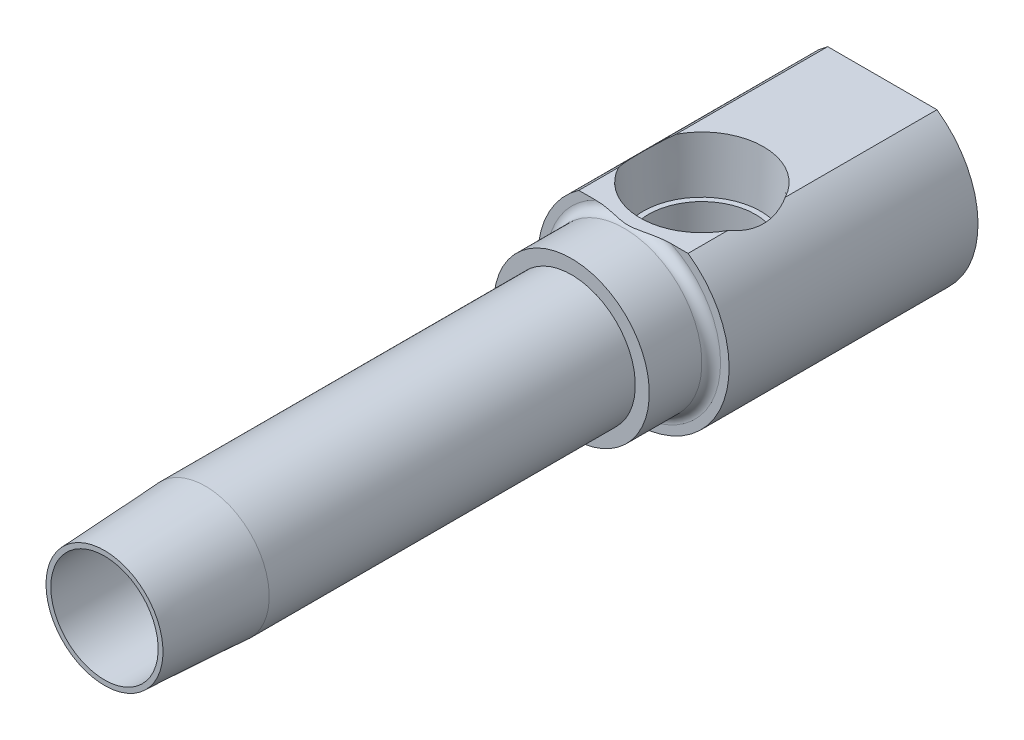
ISO-10303-21;
HEADER;
FILE_DESCRIPTION(('STEP AP214'),'2;1');
FILE_NAME('part.step','',(''),(''),'','','');
FILE_SCHEMA(('AUTOMOTIVE_DESIGN { 1 0 10303 214 1 1 1 1 }'));
ENDSEC;
DATA;
#1=APPLICATION_CONTEXT('core data for automotive mechanical design processes');
#2=APPLICATION_PROTOCOL_DEFINITION('international standard','automotive_design',2000,#1);
#3=PRODUCT_CONTEXT('',#1,'mechanical');
#4=PRODUCT('Part','Part','',(#3));
#5=PRODUCT_RELATED_PRODUCT_CATEGORY('part','',(#4));
#6=PRODUCT_DEFINITION_FORMATION('','',#4);
#7=PRODUCT_DEFINITION_CONTEXT('part definition',#1,'design');
#8=PRODUCT_DEFINITION('design','',#6,#7);
#9=PRODUCT_DEFINITION_SHAPE('','',#8);
#10=(LENGTH_UNIT() NAMED_UNIT(*) SI_UNIT(.MILLI.,.METRE.));
#11=(NAMED_UNIT(*) PLANE_ANGLE_UNIT() SI_UNIT($,.RADIAN.));
#12=(NAMED_UNIT(*) SI_UNIT($,.STERADIAN.) SOLID_ANGLE_UNIT());
#13=UNCERTAINTY_MEASURE_WITH_UNIT(LENGTH_MEASURE(1.E-05),#10,'distance_accuracy_value','');
#14=(GEOMETRIC_REPRESENTATION_CONTEXT(3) GLOBAL_UNCERTAINTY_ASSIGNED_CONTEXT((#13)) GLOBAL_UNIT_ASSIGNED_CONTEXT((#10,
#11,#12)) REPRESENTATION_CONTEXT('',''));
#15=CARTESIAN_POINT('',(0.,0.,0.));
#16=DIRECTION('',(0.,0.,1.));
#17=DIRECTION('',(1.,0.,0.));
#18=AXIS2_PLACEMENT_3D('',#15,#16,#17);
#19=CARTESIAN_POINT('',(-4.3815,0.,0.));
#20=DIRECTION('',(0.,0.,1.));
#21=DIRECTION('',(1.,0.,0.));
#22=AXIS2_PLACEMENT_3D('',#19,#20,#21);
#23=PLANE('',#22);
#24=CARTESIAN_POINT('',(0.,0.,0.));
#25=DIRECTION('',(0.,0.,-1.));
#26=DIRECTION('',(-1.,0.,0.));
#27=AXIS2_PLACEMENT_3D('',#24,#25,#26);
#28=CIRCLE('',#27,4.3815);
#29=CARTESIAN_POINT('',(-4.3815,0.,0.));
#30=VERTEX_POINT('',#29);
#31=EDGE_CURVE('E18',#30,#30,#28,.T.);
#32=ORIENTED_EDGE('',*,*,#31,.T.);
#33=EDGE_LOOP('',(#32));
#34=FACE_BOUND('',#33,.T.);
#35=CARTESIAN_POINT('',(0.,0.,0.));
#36=DIRECTION('',(0.,0.,-1.));
#37=DIRECTION('',(-1.,0.,0.));
#38=AXIS2_PLACEMENT_3D('',#35,#36,#37);
#39=CIRCLE('',#38,4.7752);
#40=CARTESIAN_POINT('',(-4.7752,0.,0.));
#41=VERTEX_POINT('',#40);
#42=EDGE_CURVE('E148',#41,#41,#39,.T.);
#43=ORIENTED_EDGE('',*,*,#42,.F.);
#44=EDGE_LOOP('',(#43));
#45=FACE_BOUND('',#44,.T.);
#46=ADVANCED_FACE('F15',(#34,#45),#23,.T.);
#47=CARTESIAN_POINT('',(0.,0.,-105.372366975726));
#48=DIRECTION('',(0.,0.,-1.));
#49=DIRECTION('',(-1.,0.,0.));
#50=AXIS2_PLACEMENT_3D('',#47,#48,#49);
#51=CYLINDRICAL_SURFACE('',#50,5.207);
#52=CARTESIAN_POINT('',(0.,0.,-8.23923482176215));
#53=DIRECTION('',(0.,0.,-1.));
#54=DIRECTION('',(-1.,0.,0.));
#55=AXIS2_PLACEMENT_3D('',#52,#53,#54);
#56=CIRCLE('',#55,5.207);
#57=CARTESIAN_POINT('',(-5.207,0.,-8.23923482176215));
#58=VERTEX_POINT('',#57);
#59=EDGE_CURVE('E150',#58,#58,#56,.T.);
#60=ORIENTED_EDGE('',*,*,#59,.T.);
#61=EDGE_LOOP('',(#60));
#62=FACE_BOUND('',#61,.T.);
#63=CARTESIAN_POINT('',(0.,0.,-38.1254));
#64=DIRECTION('',(0.,0.,-1.));
#65=DIRECTION('',(-1.,0.,0.));
#66=AXIS2_PLACEMENT_3D('',#63,#64,#65);
#67=CIRCLE('',#66,5.207);
#68=CARTESIAN_POINT('',(-5.207,0.,-38.1254));
#69=VERTEX_POINT('',#68);
#70=EDGE_CURVE('E240',#69,#69,#67,.T.);
#71=ORIENTED_EDGE('',*,*,#70,.F.);
#72=EDGE_LOOP('',(#71));
#73=FACE_BOUND('',#72,.T.);
#74=ADVANCED_FACE('F135',(#62,#73),#51,.T.);
#75=CARTESIAN_POINT('',(-4.4577,6.41348742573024,-30.1752));
#76=DIRECTION('',(0.,-1.,0.));
#77=DIRECTION('',(0.,0.,-1.));
#78=AXIS2_PLACEMENT_3D('',#75,#76,#77);
#79=PLANE('',#78);
#80=DIRECTION('',(0.,0.,-1.));
#81=VECTOR('',#80,1.);
#82=CARTESIAN_POINT('',(4.4577,6.41348742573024,-30.1752));
#83=LINE('',#82,#81);
#84=CARTESIAN_POINT('',(4.4577,6.41348742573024,-43.18));
#85=VERTEX_POINT('',#84);
#86=CARTESIAN_POINT('',(4.4577,6.41348742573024,-46.4214086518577));
#87=VERTEX_POINT('',#86);
#88=EDGE_CURVE('E293',#85,#87,#83,.T.);
#89=ORIENTED_EDGE('',*,*,#88,.T.);
#90=CARTESIAN_POINT('',(0.,6.41348742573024,-48.768));
#91=DIRECTION('',(0.,-1.,0.));
#92=DIRECTION('',(0.,0.,-1.));
#93=AXIS2_PLACEMENT_3D('',#90,#91,#92);
#94=CIRCLE('',#93,5.03761652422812);
#95=CARTESIAN_POINT('',(-4.4577,6.41348742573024,-46.4214086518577));
#96=VERTEX_POINT('',#95);
#97=EDGE_CURVE('E157',#87,#96,#94,.T.);
#98=ORIENTED_EDGE('',*,*,#97,.T.);
#99=DIRECTION('',(0.,0.,-1.));
#100=VECTOR('',#99,1.);
#101=CARTESIAN_POINT('',(-4.4577,6.41348742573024,-30.1752));
#102=LINE('',#101,#100);
#103=CARTESIAN_POINT('',(-4.4577,6.41348742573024,-43.18));
#104=VERTEX_POINT('',#103);
#105=EDGE_CURVE('E291',#104,#96,#102,.T.);
#106=ORIENTED_EDGE('',*,*,#105,.F.);
#107=DIRECTION('',(1.,0.,0.));
#108=VECTOR('',#107,1.);
#109=CARTESIAN_POINT('',(-7.112,6.41348742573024,-43.18));
#110=LINE('',#109,#108);
#111=CARTESIAN_POINT('',(-3.07371485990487,6.41348742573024,-43.18));
#112=VERTEX_POINT('',#111);
#113=EDGE_CURVE('E282',#104,#112,#110,.T.);
#114=ORIENTED_EDGE('',*,*,#113,.T.);
#115=CARTESIAN_POINT('',(0.,6.41348742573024,-42.7225064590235));
#116=CARTESIAN_POINT('',(0.0547669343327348,6.41348742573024,-42.7225026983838));
#117=CARTESIAN_POINT('',(0.10953094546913,6.41348742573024,-42.7241319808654));
#118=CARTESIAN_POINT('',(0.218888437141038,6.41348742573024,-42.7304344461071));
#119=CARTESIAN_POINT('',(0.273481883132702,6.41348742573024,-42.7351082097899));
#120=CARTESIAN_POINT('',(0.437133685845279,6.41348742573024,-42.7529547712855));
#121=CARTESIAN_POINT('',(0.545759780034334,6.41348742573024,-42.7699480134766));
#122=CARTESIAN_POINT('',(0.763468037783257,6.41348742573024,-42.8094609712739));
#123=CARTESIAN_POINT('',(0.872535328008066,6.41348742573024,-42.8320546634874));
#124=CARTESIAN_POINT('',(1.09015205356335,6.41348742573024,-42.8790057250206));
#125=CARTESIAN_POINT('',(1.19870193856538,6.41348742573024,-42.9033610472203));
#126=CARTESIAN_POINT('',(1.441224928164,6.41348742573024,-42.9572312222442));
#127=CARTESIAN_POINT('',(1.57522547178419,6.41348742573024,-42.986625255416));
#128=CARTESIAN_POINT('',(1.8440760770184,6.41348742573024,-43.0417592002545));
#129=CARTESIAN_POINT('',(1.97892653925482,6.41348742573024,-43.0674972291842));
#130=CARTESIAN_POINT('',(2.24890278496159,6.41348742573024,-43.1126462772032));
#131=CARTESIAN_POINT('',(2.38402236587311,6.41348742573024,-43.132093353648));
#132=CARTESIAN_POINT('',(2.65521795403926,6.41348742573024,-43.1622017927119));
#133=CARTESIAN_POINT('',(2.79129309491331,6.41348742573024,-43.1728702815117));
#134=CARTESIAN_POINT('',(2.99640645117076,6.41348742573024,-43.1798072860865));
#135=CARTESIAN_POINT('',(3.06529255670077,6.41348742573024,-43.1805893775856));
#136=CARTESIAN_POINT('',(3.20300193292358,6.41348742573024,-43.1785008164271));
#137=CARTESIAN_POINT('',(3.27182521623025,6.41348742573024,-43.1756312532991));
#138=CARTESIAN_POINT('',(3.40907712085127,6.41348742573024,-43.1655808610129));
#139=CARTESIAN_POINT('',(3.47750615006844,6.41348742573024,-43.158405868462));
#140=CARTESIAN_POINT('',(3.61360674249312,6.41348742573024,-43.138913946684));
#141=CARTESIAN_POINT('',(3.68127881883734,6.41348742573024,-43.1266007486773));
#142=CARTESIAN_POINT('',(3.81134745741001,6.41348742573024,-43.0966383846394));
#143=CARTESIAN_POINT('',(3.87382282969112,6.41348742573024,-43.0793388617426));
#144=CARTESIAN_POINT('',(3.99661419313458,6.41348742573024,-43.0379905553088));
#145=CARTESIAN_POINT('',(4.05692926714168,6.41348742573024,-43.0139389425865));
#146=CARTESIAN_POINT('',(4.16438836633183,6.41348742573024,-42.9619879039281));
#147=CARTESIAN_POINT('',(4.21210790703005,6.41348742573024,-42.9352964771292));
#148=CARTESIAN_POINT('',(4.30289303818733,6.41348742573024,-42.8748771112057));
#149=CARTESIAN_POINT('',(4.34597104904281,6.41348742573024,-42.8411686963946));
#150=CARTESIAN_POINT('',(4.40881816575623,6.41348742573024,-42.7806646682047));
#151=CARTESIAN_POINT('',(4.43105110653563,6.41348742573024,-42.7564380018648));
#152=CARTESIAN_POINT('',(4.47168650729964,6.41348742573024,-42.7049394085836));
#153=CARTESIAN_POINT('',(4.49009362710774,6.41348742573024,-42.6776712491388));
#154=CARTESIAN_POINT('',(4.51921410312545,6.41348742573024,-42.62504266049));
#155=CARTESIAN_POINT('',(4.53069614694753,6.41348742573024,-42.6001113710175));
#156=CARTESIAN_POINT('',(4.54935954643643,6.41348742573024,-42.54867800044));
#157=CARTESIAN_POINT('',(4.55654415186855,6.41348742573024,-42.5221771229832));
#158=CARTESIAN_POINT('',(4.56604079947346,6.41348742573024,-42.4681449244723));
#159=CARTESIAN_POINT('',(4.56832514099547,6.41348742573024,-42.4406086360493));
#160=CARTESIAN_POINT('',(4.56771494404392,6.41348742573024,-42.3855946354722));
#161=CARTESIAN_POINT('',(4.56482077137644,6.41348742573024,-42.3581169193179));
#162=CARTESIAN_POINT('',(4.55461750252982,6.41348742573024,-42.3065731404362));
#163=CARTESIAN_POINT('',(4.54772671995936,6.41348742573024,-42.2824218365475));
#164=CARTESIAN_POINT('',(4.53037439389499,6.41348742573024,-42.2354515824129));
#165=CARTESIAN_POINT('',(4.51991160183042,6.41348742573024,-42.2126331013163));
#166=CARTESIAN_POINT('',(4.49089034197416,6.41348742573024,-42.1592531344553));
#167=CARTESIAN_POINT('',(4.47078194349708,6.41348742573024,-42.1295352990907));
#168=CARTESIAN_POINT('',(4.42607813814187,6.41348742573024,-42.0736940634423));
#169=CARTESIAN_POINT('',(4.40147230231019,6.41348742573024,-42.0475792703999));
#170=CARTESIAN_POINT('',(4.33512083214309,6.41348742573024,-41.9858462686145));
#171=CARTESIAN_POINT('',(4.29121960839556,6.41348742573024,-41.952560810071));
#172=CARTESIAN_POINT('',(4.19894894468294,6.41348742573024,-41.8929920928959));
#173=CARTESIAN_POINT('',(4.1505702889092,6.41348742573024,-41.8667237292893));
#174=CARTESIAN_POINT('',(4.05679374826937,6.41348742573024,-41.8227290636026));
#175=CARTESIAN_POINT('',(4.01168660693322,6.41348742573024,-41.8043697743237));
#176=CARTESIAN_POINT('',(3.9200501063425,6.41348742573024,-41.7715828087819));
#177=CARTESIAN_POINT('',(3.8735196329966,6.41348742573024,-41.7571583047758));
#178=CARTESIAN_POINT('',(3.73245646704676,6.41348742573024,-41.7189154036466));
#179=CARTESIAN_POINT('',(3.63654836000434,6.41348742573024,-41.7001691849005));
#180=CARTESIAN_POINT('',(3.44110716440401,6.41348742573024,-41.6726004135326));
#181=CARTESIAN_POINT('',(3.34154251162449,6.41348742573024,-41.6640289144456));
#182=CARTESIAN_POINT('',(3.14195452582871,6.41348742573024,-41.6552174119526));
#183=CARTESIAN_POINT('',(3.04193075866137,6.41348742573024,-41.6549885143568));
#184=CARTESIAN_POINT('',(2.84160218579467,6.41348742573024,-41.6611359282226));
#185=CARTESIAN_POINT('',(2.7412986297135,6.41348742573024,-41.6675466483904));
#186=CARTESIAN_POINT('',(2.54132534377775,6.41348742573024,-41.6856184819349));
#187=CARTESIAN_POINT('',(2.44165493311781,6.41348742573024,-41.6972723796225));
#188=CARTESIAN_POINT('',(2.13711894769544,6.41348742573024,-41.7392639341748));
#189=CARTESIAN_POINT('',(1.93319771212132,6.41348742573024,-41.7762857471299));
#190=CARTESIAN_POINT('',(1.62827949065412,6.41348742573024,-41.8383574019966));
#191=CARTESIAN_POINT('',(1.52655364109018,6.41348742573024,-41.8601991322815));
#192=CARTESIAN_POINT('',(1.32330984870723,6.41348742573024,-41.90483124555));
#193=CARTESIAN_POINT('',(1.22179189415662,6.41348742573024,-41.9276215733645));
#194=CARTESIAN_POINT('',(1.02058637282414,6.41348742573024,-41.9721213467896));
#195=CARTESIAN_POINT('',(0.920901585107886,6.41348742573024,-41.9938431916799));
#196=CARTESIAN_POINT('',(0.720902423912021,6.41348742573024,-42.0344868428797));
#197=CARTESIAN_POINT('',(0.620587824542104,6.41348742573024,-42.0534075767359));
#198=CARTESIAN_POINT('',(0.419827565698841,6.41348742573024,-42.084865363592));
#199=CARTESIAN_POINT('',(0.319392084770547,6.41348742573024,-42.0974609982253));
#200=CARTESIAN_POINT('',(0.168224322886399,6.41348742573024,-42.1089014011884));
#201=CARTESIAN_POINT('',(0.117779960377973,6.41348742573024,-42.1114733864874));
#202=CARTESIAN_POINT('',(0.0168277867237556,6.41348742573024,-42.1138961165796));
#203=CARTESIAN_POINT('',(-0.0336800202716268,6.41348742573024,-42.113747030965));
#204=CARTESIAN_POINT('',(-0.167203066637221,6.41348742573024,-42.1097344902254));
#205=CARTESIAN_POINT('',(-0.25015161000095,6.41348742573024,-42.1035349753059));
#206=CARTESIAN_POINT('',(-0.415406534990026,6.41348742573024,-42.0853085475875));
#207=CARTESIAN_POINT('',(-0.497712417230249,6.41348742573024,-42.0732774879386));
#208=CARTESIAN_POINT('',(-0.662364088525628,6.41348742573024,-42.0454846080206));
#209=CARTESIAN_POINT('',(-0.744704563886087,6.41348742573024,-42.0296927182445));
#210=CARTESIAN_POINT('',(-0.9089542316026,6.41348742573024,-41.996225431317));
#211=CARTESIAN_POINT('',(-0.990863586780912,6.41348742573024,-41.978550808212));
#212=CARTESIAN_POINT('',(-1.15599570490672,6.41348742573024,-41.9422569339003));
#213=CARTESIAN_POINT('',(-1.23921597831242,6.41348742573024,-41.9236264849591));
#214=CARTESIAN_POINT('',(-1.40572088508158,6.41348742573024,-41.8866711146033));
#215=CARTESIAN_POINT('',(-1.48900551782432,6.41348742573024,-41.8683461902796));
#216=CARTESIAN_POINT('',(-1.73866654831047,6.41348742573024,-41.8150714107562));
#217=CARTESIAN_POINT('',(-1.90540243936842,6.41348742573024,-41.7816889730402));
#218=CARTESIAN_POINT('',(-2.16681921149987,6.41348742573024,-41.7367341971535));
#219=CARTESIAN_POINT('',(-2.26095047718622,6.41348742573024,-41.7220255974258));
#220=CARTESIAN_POINT('',(-2.4497155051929,6.41348742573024,-41.6963487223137));
#221=CARTESIAN_POINT('',(-2.54434917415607,6.41348742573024,-41.6853797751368));
#222=CARTESIAN_POINT('',(-2.73368335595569,6.41348742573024,-41.6682011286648));
#223=CARTESIAN_POINT('',(-2.82838206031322,6.41348742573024,-41.6619724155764));
#224=CARTESIAN_POINT('',(-3.01793602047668,6.41348742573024,-41.6553721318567));
#225=CARTESIAN_POINT('',(-3.11279113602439,6.41348742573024,-41.6549967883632));
#226=CARTESIAN_POINT('',(-3.31218734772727,6.41348742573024,-41.6618981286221));
#227=CARTESIAN_POINT('',(-3.41671052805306,6.41348742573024,-41.6699741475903));
#228=CARTESIAN_POINT('',(-3.57234667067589,6.41348742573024,-41.6908108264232));
#229=CARTESIAN_POINT('',(-3.6240470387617,6.41348742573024,-41.6992134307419));
#230=CARTESIAN_POINT('',(-3.72677708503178,6.41348742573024,-41.7193929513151));
#231=CARTESIAN_POINT('',(-3.77780699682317,6.41348742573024,-41.7311686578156));
#232=CARTESIAN_POINT('',(-3.89634421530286,6.41348742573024,-41.7634037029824));
#233=CARTESIAN_POINT('',(-3.96343170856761,6.41348742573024,-41.7854581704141));
#234=CARTESIAN_POINT('',(-4.09405850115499,6.41348742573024,-41.8384132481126));
#235=CARTESIAN_POINT('',(-4.15760463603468,6.41348742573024,-41.8692960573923));
#236=CARTESIAN_POINT('',(-4.25441976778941,6.41348742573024,-41.9278884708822));
#237=CARTESIAN_POINT('',(-4.28979385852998,6.41348742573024,-41.9520976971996));
#238=CARTESIAN_POINT('',(-4.35685699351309,6.41348742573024,-42.0052233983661));
#239=CARTESIAN_POINT('',(-4.38855051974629,6.41348742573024,-42.03413404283));
#240=CARTESIAN_POINT('',(-4.43937896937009,6.41348742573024,-42.0894131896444));
#241=CARTESIAN_POINT('',(-4.45969325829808,6.41348742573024,-42.1146886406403));
#242=CARTESIAN_POINT('',(-4.49606293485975,6.41348742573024,-42.1681532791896));
#243=CARTESIAN_POINT('',(-4.51212457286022,6.41348742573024,-42.1963381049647));
#244=CARTESIAN_POINT('',(-4.53626721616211,6.41348742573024,-42.2497297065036));
#245=CARTESIAN_POINT('',(-4.54527744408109,6.41348742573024,-42.2745134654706));
#246=CARTESIAN_POINT('',(-4.55902605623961,6.41348742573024,-42.3252436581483));
#247=CARTESIAN_POINT('',(-4.56376753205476,6.41348742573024,-42.351189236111));
#248=CARTESIAN_POINT('',(-4.56859445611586,6.41348742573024,-42.403605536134));
#249=CARTESIAN_POINT('',(-4.5686642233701,6.41348742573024,-42.4300777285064));
#250=CARTESIAN_POINT('',(-4.56410153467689,6.41348742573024,-42.482612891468));
#251=CARTESIAN_POINT('',(-4.55946793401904,6.41348742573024,-42.5086757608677));
#252=CARTESIAN_POINT('',(-4.54620785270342,6.41348742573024,-42.5584509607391));
#253=CARTESIAN_POINT('',(-4.53777611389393,6.41348742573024,-42.5822162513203));
#254=CARTESIAN_POINT('',(-4.51754524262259,6.41348742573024,-42.6282512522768));
#255=CARTESIAN_POINT('',(-4.50574488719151,6.41348742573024,-42.6505204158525));
#256=CARTESIAN_POINT('',(-4.47265204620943,6.41348742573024,-42.7042366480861));
#257=CARTESIAN_POINT('',(-4.44958451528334,6.41348742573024,-42.7345900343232));
#258=CARTESIAN_POINT('',(-4.39893449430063,6.41348742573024,-42.7912628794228));
#259=CARTESIAN_POINT('',(-4.37134039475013,6.41348742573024,-42.8175716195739));
#260=CARTESIAN_POINT('',(-4.29637766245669,6.41348742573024,-42.8803367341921));
#261=CARTESIAN_POINT('',(-4.2467063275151,6.41348742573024,-42.9140236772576));
#262=CARTESIAN_POINT('',(-4.1429475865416,6.41348742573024,-42.973603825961));
#263=CARTESIAN_POINT('',(-4.08885088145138,6.41348742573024,-42.9994800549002));
#264=CARTESIAN_POINT('',(-3.98330416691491,6.41348742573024,-43.0426658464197));
#265=CARTESIAN_POINT('',(-3.93208515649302,6.41348742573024,-43.0605529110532));
#266=CARTESIAN_POINT('',(-3.82828626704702,6.41348742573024,-43.091892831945));
#267=CARTESIAN_POINT('',(-3.77570527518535,6.41348742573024,-43.1053419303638));
#268=CARTESIAN_POINT('',(-3.66966451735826,6.41348742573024,-43.1284674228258));
#269=CARTESIAN_POINT('',(-3.61620370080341,6.41348742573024,-43.1381389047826));
#270=CARTESIAN_POINT('',(-3.50882362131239,6.41348742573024,-43.1542139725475));
#271=CARTESIAN_POINT('',(-3.45490452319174,6.41348742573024,-43.1606186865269));
#272=CARTESIAN_POINT('',(-3.32893010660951,6.41348742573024,-43.1722546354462));
#273=CARTESIAN_POINT('',(-3.25677506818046,6.41348742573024,-43.1763969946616));
#274=CARTESIAN_POINT('',(-3.11233636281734,6.41348742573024,-43.1804999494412));
#275=CARTESIAN_POINT('',(-3.04005265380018,6.41348742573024,-43.1804587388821));
#276=CARTESIAN_POINT('',(-2.8231114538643,6.41348742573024,-43.175065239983));
#277=CARTESIAN_POINT('',(-2.67858508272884,6.41348742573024,-43.1644271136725));
#278=CARTESIAN_POINT('',(-2.38941343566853,6.41348742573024,-43.1330264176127));
#279=CARTESIAN_POINT('',(-2.24477928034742,6.41348742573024,-43.1121716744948));
#280=CARTESIAN_POINT('',(-1.95690250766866,6.41348742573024,-43.0635783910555));
#281=CARTESIAN_POINT('',(-1.81365833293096,6.41348742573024,-43.0358487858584));
#282=CARTESIAN_POINT('',(-1.53108031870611,6.41348742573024,-42.9771540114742));
#283=CARTESIAN_POINT('',(-1.39172865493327,6.41348742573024,-42.9462712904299));
#284=CARTESIAN_POINT('',(-1.18259583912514,6.41348742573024,-42.899745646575));
#285=CARTESIAN_POINT('',(-1.11279428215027,6.41348742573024,-42.8841871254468));
#286=CARTESIAN_POINT('',(-0.97306919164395,6.41348742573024,-42.8536319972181));
#287=CARTESIAN_POINT('',(-0.903145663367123,6.41348742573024,-42.8386353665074));
#288=CARTESIAN_POINT('',(-0.764296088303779,6.41348742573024,-42.8102594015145));
#289=CARTESIAN_POINT('',(-0.695375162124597,6.41348742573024,-42.7968555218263));
#290=CARTESIAN_POINT('',(-0.557105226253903,6.41348742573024,-42.772372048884));
#291=CARTESIAN_POINT('',(-0.487756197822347,6.41348742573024,-42.7612925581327));
#292=CARTESIAN_POINT('',(-0.348841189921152,6.41348742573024,-42.7427649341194));
#293=CARTESIAN_POINT('',(-0.27927725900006,6.41348742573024,-42.7353021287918));
#294=CARTESIAN_POINT('',(-0.139807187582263,6.41348742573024,-42.725176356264));
#295=CARTESIAN_POINT('',(-0.069901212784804,6.41348742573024,-42.7225112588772));
#296=CARTESIAN_POINT('',(0.,6.41348742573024,-42.7225064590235));
#297=B_SPLINE_CURVE_WITH_KNOTS('',3,(#115,#116,#117,#118,#119,#120,#121,#122,#123,#124,#125,
#126,#127,#128,#129,#130,#131,#132,#133,#134,#135,#136,#137,#138,#139,#140,#141,#142,#143,#144,
#145,#146,#147,#148,#149,#150,#151,#152,#153,#154,#155,#156,#157,#158,#159,#160,#161,#162,#163,
#164,#165,#166,#167,#168,#169,#170,#171,#172,#173,#174,#175,#176,#177,#178,#179,#180,#181,#182,
#183,#184,#185,#186,#187,#188,#189,#190,#191,#192,#193,#194,#195,#196,#197,#198,#199,#200,#201,
#202,#203,#204,#205,#206,#207,#208,#209,#210,#211,#212,#213,#214,#215,#216,#217,#218,#219,#220,
#221,#222,#223,#224,#225,#226,#227,#228,#229,#230,#231,#232,#233,#234,#235,#236,#237,#238,#239,
#240,#241,#242,#243,#244,#245,#246,#247,#248,#249,#250,#251,#252,#253,#254,#255,#256,#257,#258,
#259,#260,#261,#262,#263,#264,#265,#266,#267,#268,#269,#270,#271,#272,#273,#274,#275,#276,#277,
#278,#279,#280,#281,#282,#283,#284,#285,#286,#287,#288,#289,#290,#291,#292,#293,#294,#295,#296),
.UNSPECIFIED.,.T.,.F.,(4,2,2,2,2,2,2,2,2,2,2,2,2,2,2,2,2,2,2,2,2,2,2,2,2,2,2,2,2,2,2,2,2,2,2,2,
2,2,2,2,2,2,2,2,2,2,2,2,2,2,2,2,2,2,2,2,2,2,2,2,2,2,2,2,2,2,2,2,2,2,2,2,2,2,2,2,2,2,2,2,2,2,2,2,
2,2,2,2,2,2,4),(0.,0.164273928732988,0.328579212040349,0.658096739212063,0.992223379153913,
1.32596779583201,1.73751584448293,2.14927506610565,2.55863060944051,2.96765352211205,
3.17424892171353,3.38078269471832,3.5870371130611,3.79314201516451,3.98733137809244,
4.18160222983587,4.34518473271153,4.50831802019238,4.60668262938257,4.70492671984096,
4.78693922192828,4.86888962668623,4.95130208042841,5.03370871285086,5.10874003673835,
5.18379761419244,5.29083718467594,5.39812818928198,5.5624830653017,5.72718409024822,
5.87307196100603,6.01907710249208,6.31139884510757,6.61079267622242,6.91058505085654,
7.21193886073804,7.51287920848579,8.13412004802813,8.44626765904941,8.75839714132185,
9.06445930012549,9.37063833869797,9.67392675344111,9.82538795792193,9.97683972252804,
10.2260774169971,10.4754926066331,10.7269732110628,10.9783508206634,11.2341897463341,
11.490026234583,11.9999950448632,12.285756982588,12.5714675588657,12.8560259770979,
13.140400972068,13.4543312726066,13.6113768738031,13.7683662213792,13.9797728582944,
14.1907561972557,14.3190471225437,14.4471801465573,14.5441362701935,14.6409490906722,
14.7197308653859,14.7984555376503,14.8774444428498,14.9564525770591,15.031803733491,
15.1071822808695,15.2209045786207,15.3349232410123,15.5139662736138,15.6933957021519,
15.8559161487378,16.0185738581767,16.1814423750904,16.344254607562,16.5609200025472,
16.7776789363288,17.2118589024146,17.6500302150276,18.0876350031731,18.5158248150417,
18.7303690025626,18.9449041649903,19.1555191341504,19.3661433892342,19.5759058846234,
19.7855752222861),.UNSPECIFIED.);
#298=CARTESIAN_POINT('',(3.07371485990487,6.41348742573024,-43.18));
#299=VERTEX_POINT('',#298);
#300=EDGE_CURVE('E232',#112,#299,#297,.T.);
#301=ORIENTED_EDGE('',*,*,#300,.T.);
#302=EDGE_CURVE('E297',#299,#85,#110,.T.);
#303=ORIENTED_EDGE('',*,*,#302,.T.);
#304=EDGE_LOOP('',(#89,#98,#106,#114,#301,#303));
#305=FACE_BOUND('',#304,.T.);
#306=ADVANCED_FACE('F141',(#305),#79,.F.);
#307=CARTESIAN_POINT('',(0.,0.,-105.372366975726));
#308=DIRECTION('',(0.,0.,-1.));
#309=DIRECTION('',(-1.,0.,0.));
#310=AXIS2_PLACEMENT_3D('',#307,#308,#309);
#311=CYLINDRICAL_SURFACE('',#310,4.3815);
#312=ORIENTED_EDGE('',*,*,#31,.F.);
#313=EDGE_LOOP('',(#312));
#314=FACE_BOUND('',#313,.T.);
#315=CARTESIAN_POINT('',(0.,0.,-38.1254));
#316=DIRECTION('',(0.,0.,-1.));
#317=DIRECTION('',(-1.,0.,0.));
#318=AXIS2_PLACEMENT_3D('',#315,#316,#317);
#319=CIRCLE('',#318,4.3815);
#320=CARTESIAN_POINT('',(-3.16538744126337,-3.02949906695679,-38.1254));
#321=VERTEX_POINT('',#320);
#322=CARTESIAN_POINT('',(3.16538744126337,-3.02949906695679,-38.1254));
#323=VERTEX_POINT('',#322);
#324=EDGE_CURVE('E235',#321,#323,#319,.T.);
#325=ORIENTED_EDGE('',*,*,#324,.T.);
#326=CARTESIAN_POINT('',(3.16547479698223,-3.02940779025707,-38.1256));
#327=CARTESIAN_POINT('',(3.14342446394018,-3.05243943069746,-38.0750770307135));
#328=CARTESIAN_POINT('',(3.11972293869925,-3.07670954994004,-38.0258482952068));
#329=CARTESIAN_POINT('',(3.0688820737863,-3.12742914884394,-37.9303949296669));
#330=CARTESIAN_POINT('',(3.04174325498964,-3.15387829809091,-37.8841698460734));
#331=CARTESIAN_POINT('',(2.95559153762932,-3.23545829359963,-37.751577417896));
#332=CARTESIAN_POINT('',(2.89136505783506,-3.29334010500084,-37.6701678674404));
#333=CARTESIAN_POINT('',(2.75011359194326,-3.41217163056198,-37.5222713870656));
#334=CARTESIAN_POINT('',(2.67308610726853,-3.47312194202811,-37.4557873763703));
#335=CARTESIAN_POINT('',(2.50819184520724,-3.5940223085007,-37.3363421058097));
#336=CARTESIAN_POINT('',(2.42029620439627,-3.653969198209,-37.2834180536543));
#337=CARTESIAN_POINT('',(2.25775713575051,-3.75593106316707,-37.2002361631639));
#338=CARTESIAN_POINT('',(2.18486784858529,-3.7988442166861,-37.1675756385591));
#339=CARTESIAN_POINT('',(2.03488862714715,-3.8812485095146,-37.1079906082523));
#340=CARTESIAN_POINT('',(1.95779677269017,-3.92073806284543,-37.0810687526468));
#341=CARTESIAN_POINT('',(1.80004579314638,-3.99562399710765,-37.0321173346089));
#342=CARTESIAN_POINT('',(1.71938265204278,-4.03101559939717,-37.0100934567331));
#343=CARTESIAN_POINT('',(1.55515017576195,-4.09718246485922,-36.9703041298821));
#344=CARTESIAN_POINT('',(1.47157967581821,-4.12795585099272,-36.9525404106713));
#345=CARTESIAN_POINT('',(1.21289030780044,-4.21425858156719,-36.9040052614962));
#346=CARTESIAN_POINT('',(1.03389313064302,-4.26180132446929,-36.8791923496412));
#347=CARTESIAN_POINT('',(0.670227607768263,-4.33390350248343,-36.8423899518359));
#348=CARTESIAN_POINT('',(0.485562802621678,-4.35847699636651,-36.8303926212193));
#349=CARTESIAN_POINT('',(0.191999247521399,-4.37863265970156,-36.8205802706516));
#350=CARTESIAN_POINT('',(0.0836976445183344,-4.38203983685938,-36.8189331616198));
#351=CARTESIAN_POINT('',(-0.13284208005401,-4.38082235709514,-36.8195203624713));
#352=CARTESIAN_POINT('',(-0.241080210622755,-4.37619962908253,-36.8217537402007));
#353=CARTESIAN_POINT('',(-0.456961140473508,-4.35895390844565,-36.8301802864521));
#354=CARTESIAN_POINT('',(-0.564602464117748,-4.34631610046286,-36.8363807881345));
#355=CARTESIAN_POINT('',(-0.778298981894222,-4.31317491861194,-36.8529612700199));
#356=CARTESIAN_POINT('',(-0.884354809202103,-4.29267477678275,-36.8633395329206));
#357=CARTESIAN_POINT('',(-1.09632494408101,-4.24354696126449,-36.8889134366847));
#358=CARTESIAN_POINT('',(-1.20219105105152,-4.21476010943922,-36.9042041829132));
#359=CARTESIAN_POINT('',(-1.41060084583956,-4.14965783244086,-36.9401347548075));
#360=CARTESIAN_POINT('',(-1.513146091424,-4.11334599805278,-36.9607720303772));
#361=CARTESIAN_POINT('',(-1.71390456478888,-4.03381995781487,-37.0082587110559));
#362=CARTESIAN_POINT('',(-1.81212318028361,-3.99061466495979,-37.0351001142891));
#363=CARTESIAN_POINT('',(-2.00320334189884,-3.89820353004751,-37.0961923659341));
#364=CARTESIAN_POINT('',(-2.09606839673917,-3.84900168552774,-37.1304382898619));
#365=CARTESIAN_POINT('',(-2.29534319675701,-3.73428068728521,-37.2166611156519));
#366=CARTESIAN_POINT('',(-2.4001461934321,-3.66757137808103,-37.2708898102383));
#367=CARTESIAN_POINT('',(-2.54748315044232,-3.56531535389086,-37.3646882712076));
#368=CARTESIAN_POINT('',(-2.59488453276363,-3.53092006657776,-37.3979687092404));
#369=CARTESIAN_POINT('',(-2.68608105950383,-3.46204578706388,-37.4690517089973));
#370=CARTESIAN_POINT('',(-2.72987823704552,-3.42756685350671,-37.506851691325));
#371=CARTESIAN_POINT('',(-2.81247040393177,-3.36010888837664,-37.5862206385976));
#372=CARTESIAN_POINT('',(-2.85136068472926,-3.32711374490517,-37.6276764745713));
#373=CARTESIAN_POINT('',(-2.92505072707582,-3.26251751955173,-37.7150852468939));
#374=CARTESIAN_POINT('',(-2.95985031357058,-3.23091649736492,-37.7610383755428));
#375=CARTESIAN_POINT('',(-3.02566242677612,-3.16938090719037,-37.8578655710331));
#376=CARTESIAN_POINT('',(-3.05661307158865,-3.1394769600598,-37.9088010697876));
#377=CARTESIAN_POINT('',(-3.11423662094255,-3.08232206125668,-38.014485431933));
#378=CARTESIAN_POINT('',(-3.14090735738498,-3.05507245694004,-38.0692362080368));
#379=CARTESIAN_POINT('',(-3.16547479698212,-3.02940779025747,-38.1256000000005));
#380=B_SPLINE_CURVE_WITH_KNOTS('',3,(#326,#327,#328,#329,#330,#331,#332,#333,#334,#335,#336,
#337,#338,#339,#340,#341,#342,#343,#344,#345,#346,#347,#348,#349,#350,#351,#352,#353,#354,#355,
#356,#357,#358,#359,#360,#361,#362,#363,#364,#365,#366,#367,#368,#369,#370,#371,#372,#373,#374,
#375,#376,#377,#378,#379),.UNSPECIFIED.,.F.,.F.,(4,2,2,2,2,2,2,2,2,2,2,2,2,2,2,2,2,2,2,2,2,2,2,
2,2,2,4),(0.,0.179155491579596,0.358283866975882,0.712611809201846,1.06700899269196,
1.42236845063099,1.69403668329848,1.96583010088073,2.23793733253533,2.51015486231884,
3.06856026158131,3.62662365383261,3.95140246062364,4.27610326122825,4.6014060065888,
4.92657516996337,5.25846293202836,5.5901926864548,5.92149695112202,6.25258155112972,
6.65760632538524,6.85948934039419,7.06125768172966,7.25815107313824,7.45505288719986,
7.654795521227,7.85463902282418),.UNSPECIFIED.);
#381=EDGE_CURVE('E203',#323,#321,#380,.T.);
#382=ORIENTED_EDGE('',*,*,#381,.T.);
#383=EDGE_LOOP('',(#325,#382));
#384=FACE_BOUND('',#383,.T.);
#385=ADVANCED_FACE('F234',(#314,#384),#311,.F.);
#386=CARTESIAN_POINT('',(-4.3815,0.,-38.1254));
#387=DIRECTION('',(0.,0.,1.));
#388=DIRECTION('',(1.,0.,0.));
#389=AXIS2_PLACEMENT_3D('',#386,#387,#388);
#390=PLANE('',#389);
#391=ORIENTED_EDGE('',*,*,#324,.F.);
#392=CARTESIAN_POINT('',(0.,-0.364745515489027,-38.1254));
#393=DIRECTION('',(0.,0.,1.));
#394=DIRECTION('',(0.,1.,0.));
#395=AXIS2_PLACEMENT_3D('',#392,#393,#394);
#396=ELLIPSE('',#395,4.20023414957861,4.09504169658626);
#397=EDGE_CURVE('E195',#321,#323,#396,.F.);
#398=ORIENTED_EDGE('',*,*,#397,.T.);
#399=EDGE_LOOP('',(#391,#398));
#400=FACE_BOUND('',#399,.T.);
#401=ADVANCED_FACE('F237',(#400),#390,.T.);
#402=CARTESIAN_POINT('',(-5.207,0.,-38.1254));
#403=DIRECTION('',(0.,0.,1.));
#404=DIRECTION('',(1.,0.,0.));
#405=AXIS2_PLACEMENT_3D('',#402,#403,#404);
#406=PLANE('',#405);
#407=ORIENTED_EDGE('',*,*,#70,.T.);
#408=EDGE_LOOP('',(#407));
#409=FACE_BOUND('',#408,.T.);
#410=CARTESIAN_POINT('',(0.,0.,-38.1254));
#411=DIRECTION('',(0.,0.,-1.));
#412=DIRECTION('',(-1.,0.,0.));
#413=AXIS2_PLACEMENT_3D('',#410,#411,#412);
#414=CIRCLE('',#413,6.35);
#415=CARTESIAN_POINT('',(-6.35,0.,-38.1254));
#416=VERTEX_POINT('',#415);
#417=EDGE_CURVE('E273',#416,#416,#414,.T.);
#418=ORIENTED_EDGE('',*,*,#417,.F.);
#419=EDGE_LOOP('',(#418));
#420=FACE_BOUND('',#419,.T.);
#421=ADVANCED_FACE('F382',(#409,#420),#406,.T.);
#422=CARTESIAN_POINT('',(-7.8105,0.,-63.5));
#423=DIRECTION('',(0.,0.,-1.));
#424=DIRECTION('',(-1.,0.,0.));
#425=AXIS2_PLACEMENT_3D('',#422,#423,#424);
#426=PLANE('',#425);
#427=DIRECTION('',(1.,0.,0.));
#428=VECTOR('',#427,1.);
#429=CARTESIAN_POINT('',(-2.29502505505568,3.9751,-63.5));
#430=LINE('',#429,#428);
#431=CARTESIAN_POINT('',(-2.29502505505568,3.9751,-63.5));
#432=VERTEX_POINT('',#431);
#433=CARTESIAN_POINT('',(2.29502505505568,3.9751,-63.5));
#434=VERTEX_POINT('',#433);
#435=EDGE_CURVE('E236',#432,#434,#430,.T.);
#436=ORIENTED_EDGE('',*,*,#435,.F.);
#437=DIRECTION('',(0.5,0.866025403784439,0.));
#438=VECTOR('',#437,1.);
#439=CARTESIAN_POINT('',(-4.59005011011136,0.,-63.5));
#440=LINE('',#439,#438);
#441=CARTESIAN_POINT('',(-4.59005011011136,0.,-63.5));
#442=VERTEX_POINT('',#441);
#443=EDGE_CURVE('E323',#442,#432,#440,.T.);
#444=ORIENTED_EDGE('',*,*,#443,.F.);
#445=DIRECTION('',(-0.5,0.866025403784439,0.));
#446=VECTOR('',#445,1.);
#447=CARTESIAN_POINT('',(-2.29502505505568,-3.9751,-63.5));
#448=LINE('',#447,#446);
#449=CARTESIAN_POINT('',(-2.29502505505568,-3.9751,-63.5));
#450=VERTEX_POINT('',#449);
#451=EDGE_CURVE('E327',#450,#442,#448,.T.);
#452=ORIENTED_EDGE('',*,*,#451,.F.);
#453=DIRECTION('',(-1.,0.,0.));
#454=VECTOR('',#453,1.);
#455=CARTESIAN_POINT('',(2.29502505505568,-3.9751,-63.5));
#456=LINE('',#455,#454);
#457=CARTESIAN_POINT('',(2.29502505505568,-3.9751,-63.5));
#458=VERTEX_POINT('',#457);
#459=EDGE_CURVE('E330',#458,#450,#456,.T.);
#460=ORIENTED_EDGE('',*,*,#459,.F.);
#461=DIRECTION('',(-0.5,-0.866025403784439,0.));
#462=VECTOR('',#461,1.);
#463=CARTESIAN_POINT('',(4.59005011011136,0.,-63.5));
#464=LINE('',#463,#462);
#465=CARTESIAN_POINT('',(4.59005011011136,0.,-63.5));
#466=VERTEX_POINT('',#465);
#467=EDGE_CURVE('E333',#466,#458,#464,.T.);
#468=ORIENTED_EDGE('',*,*,#467,.F.);
#469=DIRECTION('',(0.5,-0.866025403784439,0.));
#470=VECTOR('',#469,1.);
#471=CARTESIAN_POINT('',(2.29502505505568,3.9751,-63.5));
#472=LINE('',#471,#470);
#473=EDGE_CURVE('E336',#434,#466,#472,.T.);
#474=ORIENTED_EDGE('',*,*,#473,.F.);
#475=EDGE_LOOP('',(#436,#444,#452,#460,#468,#474));
#476=FACE_BOUND('',#475,.T.);
#477=DIRECTION('',(-1.,0.,0.));
#478=VECTOR('',#477,1.);
#479=CARTESIAN_POINT('',(-4.4577,6.41348742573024,-63.5));
#480=LINE('',#479,#478);
#481=CARTESIAN_POINT('',(4.4577,6.41348742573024,-63.5));
#482=VERTEX_POINT('',#481);
#483=CARTESIAN_POINT('',(-4.4577,6.41348742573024,-63.5));
#484=VERTEX_POINT('',#483);
#485=EDGE_CURVE('E306',#482,#484,#480,.T.);
#486=ORIENTED_EDGE('',*,*,#485,.F.);
#487=CARTESIAN_POINT('',(0.,0.,-63.5));
#488=DIRECTION('',(0.,0.,-1.));
#489=DIRECTION('',(-1.,0.,0.));
#490=AXIS2_PLACEMENT_3D('',#487,#488,#489);
#491=CIRCLE('',#490,7.8105);
#492=EDGE_CURVE('E238',#482,#484,#491,.T.);
#493=ORIENTED_EDGE('',*,*,#492,.T.);
#494=EDGE_LOOP('',(#486,#493));
#495=FACE_BOUND('',#494,.T.);
#496=ADVANCED_FACE('F379',(#476,#495),#426,.T.);
#497=CARTESIAN_POINT('',(0.,0.,-105.372366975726));
#498=DIRECTION('',(0.,0.,-1.));
#499=DIRECTION('',(-1.,0.,0.));
#500=AXIS2_PLACEMENT_3D('',#497,#498,#499);
#501=CYLINDRICAL_SURFACE('',#500,7.8105);
#502=CARTESIAN_POINT('',(3.4919694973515,6.98641963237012,-45.0954411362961));
#503=CARTESIAN_POINT('',(3.58906870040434,6.93789608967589,-45.1912988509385));
#504=CARTESIAN_POINT('',(3.68214837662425,6.88883405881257,-45.2909403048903));
#505=CARTESIAN_POINT('',(3.86002319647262,6.79075982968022,-45.4974701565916));
#506=CARTESIAN_POINT('',(3.94481473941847,6.74174766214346,-45.6043616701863));
#507=CARTESIAN_POINT('',(4.10630083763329,6.64463270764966,-45.8256968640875));
#508=CARTESIAN_POINT('',(4.182939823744,6.59653779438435,-45.9401846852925));
#509=CARTESIAN_POINT('',(4.32709776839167,6.50288590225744,-46.1756666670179));
#510=CARTESIAN_POINT('',(4.39461854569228,6.4573284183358,-46.2966595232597));
#511=CARTESIAN_POINT('',(4.56617688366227,6.33809707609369,-46.6359311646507));
#512=CARTESIAN_POINT('',(4.66075954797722,6.26825649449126,-46.860584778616));
#513=CARTESIAN_POINT('',(4.77884662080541,6.17810554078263,-47.208872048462));
#514=CARTESIAN_POINT('',(4.81422585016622,6.15050630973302,-47.3267543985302));
#515=CARTESIAN_POINT('',(4.87674528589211,6.10105356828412,-47.5658431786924));
#516=CARTESIAN_POINT('',(4.90388968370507,6.07919713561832,-47.6870478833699));
#517=CARTESIAN_POINT('',(4.94976694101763,6.04190398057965,-47.9331239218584));
#518=CARTESIAN_POINT('',(4.96842532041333,6.02652418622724,-48.0580178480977));
#519=CARTESIAN_POINT('',(4.99667728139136,6.00312132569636,-48.3095203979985));
#520=CARTESIAN_POINT('',(5.00627099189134,5.99509815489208,-48.4361289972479));
#521=CARTESIAN_POINT('',(5.01621670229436,5.98677905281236,-48.6899991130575));
#522=CARTESIAN_POINT('',(5.01656623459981,5.98648518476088,-48.8172607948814));
#523=CARTESIAN_POINT('',(5.00801128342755,5.99364363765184,-49.0712426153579));
#524=CARTESIAN_POINT('',(4.99910747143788,6.00109539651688,-49.1979627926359));
#525=CARTESIAN_POINT('',(4.97354185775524,6.02229474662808,-49.4373118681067));
#526=CARTESIAN_POINT('',(4.95773418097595,6.03534698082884,-49.5500951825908));
#527=CARTESIAN_POINT('',(4.91896243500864,6.06698770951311,-49.7736492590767));
#528=CARTESIAN_POINT('',(4.89599540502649,6.08557849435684,-49.8844191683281));
#529=CARTESIAN_POINT('',(4.81679293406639,6.1487401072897,-50.2125503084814));
#530=CARTESIAN_POINT('',(4.75021164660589,6.20073954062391,-50.4261377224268));
#531=CARTESIAN_POINT('',(4.63945981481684,6.28338047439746,-50.7153340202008));
#532=CARTESIAN_POINT('',(4.60576203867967,6.30815266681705,-50.7969415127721));
#533=CARTESIAN_POINT('',(4.53447848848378,6.35958762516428,-50.9578188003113));
#534=CARTESIAN_POINT('',(4.49689343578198,6.38625004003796,-51.0370890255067));
#535=CARTESIAN_POINT('',(4.32205340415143,6.50775479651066,-51.382823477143));
#536=CARTESIAN_POINT('',(4.16440692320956,6.61093131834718,-51.6363955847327));
#537=CARTESIAN_POINT('',(3.80845756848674,6.82220207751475,-52.1113694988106));
#538=CARTESIAN_POINT('',(3.61008660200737,6.93030431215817,-52.3327163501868));
#539=CARTESIAN_POINT('',(3.29682765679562,7.08140586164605,-52.625508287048));
#540=CARTESIAN_POINT('',(3.19689867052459,7.1271632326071,-52.7118360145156));
#541=CARTESIAN_POINT('',(2.99025804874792,7.21629286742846,-52.8764958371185));
#542=CARTESIAN_POINT('',(2.88356945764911,7.25967238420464,-52.9548529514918));
#543=CARTESIAN_POINT('',(2.77344990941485,7.30149887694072,-53.0291555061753));
#544=B_SPLINE_CURVE_WITH_KNOTS('',3,(#502,#503,#504,#505,#506,#507,#508,#509,#510,#511,#512,
#513,#514,#515,#516,#517,#518,#519,#520,#521,#522,#523,#524,#525,#526,#527,#528,#529,#530,#531,
#532,#533,#534,#535,#536,#537,#538,#539,#540,#541,#542,#543),.UNSPECIFIED.,.F.,.F.,(4,2,2,2,2,2,
2,2,2,2,2,2,2,2,2,2,2,2,2,2,4),(0.,0.434323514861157,0.86883488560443,1.3061401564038,
1.74335807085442,2.50066107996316,2.87871388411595,3.25657393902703,3.63768926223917,
4.01879916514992,4.40001079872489,4.78119477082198,5.12468887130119,5.46832521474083,
6.15438371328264,6.42940501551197,6.70437537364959,7.6470941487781,8.59140221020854,
9.01031754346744,9.42787448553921),.UNSPECIFIED.);
#545=CARTESIAN_POINT('',(4.4577,6.41348742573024,-51.1145913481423));
#546=VERTEX_POINT('',#545);
#547=EDGE_CURVE('E30',#87,#546,#544,.T.);
#548=ORIENTED_EDGE('',*,*,#547,.F.);
#549=ORIENTED_EDGE('',*,*,#88,.F.);
#550=CARTESIAN_POINT('',(0.,0.,-43.18));
#551=DIRECTION('',(0.,0.,-1.));
#552=DIRECTION('',(-1.,0.,0.));
#553=AXIS2_PLACEMENT_3D('',#550,#551,#552);
#554=CIRCLE('',#553,7.8105);
#555=EDGE_CURVE('E242',#85,#104,#554,.T.);
#556=ORIENTED_EDGE('',*,*,#555,.T.);
#557=ORIENTED_EDGE('',*,*,#105,.T.);
#558=CARTESIAN_POINT('',(-3.4919694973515,6.98641963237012,-52.440558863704));
#559=CARTESIAN_POINT('',(-3.5890687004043,6.9378960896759,-52.3447011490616));
#560=CARTESIAN_POINT('',(-3.6821483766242,6.8888340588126,-52.2450596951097));
#561=CARTESIAN_POINT('',(-3.86002319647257,6.79075982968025,-52.0385298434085));
#562=CARTESIAN_POINT('',(-3.94481473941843,6.74174766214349,-51.9316383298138));
#563=CARTESIAN_POINT('',(-4.10630083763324,6.64463270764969,-51.7103031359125));
#564=CARTESIAN_POINT('',(-4.18293982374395,6.59653779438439,-51.5958153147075));
#565=CARTESIAN_POINT('',(-4.32709776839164,6.50288590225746,-51.3603333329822));
#566=CARTESIAN_POINT('',(-4.39461854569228,6.45732841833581,-51.2393404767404));
#567=CARTESIAN_POINT('',(-4.5661768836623,6.33809707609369,-50.9000688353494));
#568=CARTESIAN_POINT('',(-4.6607595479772,6.26825649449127,-50.6754152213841));
#569=CARTESIAN_POINT('',(-4.77884662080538,6.17810554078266,-50.327127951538));
#570=CARTESIAN_POINT('',(-4.81422585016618,6.15050630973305,-50.2092456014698));
#571=CARTESIAN_POINT('',(-4.87674528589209,6.10105356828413,-49.9701568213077));
#572=CARTESIAN_POINT('',(-4.90388968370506,6.07919713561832,-49.8489521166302));
#573=CARTESIAN_POINT('',(-4.94976694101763,6.04190398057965,-49.6028760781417));
#574=CARTESIAN_POINT('',(-4.96842532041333,6.02652418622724,-49.4779821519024));
#575=CARTESIAN_POINT('',(-4.99667728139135,6.00312132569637,-49.2264796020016));
#576=CARTESIAN_POINT('',(-5.00627099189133,5.99509815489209,-49.0998710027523));
#577=CARTESIAN_POINT('',(-5.01621670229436,5.98677905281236,-48.8460008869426));
#578=CARTESIAN_POINT('',(-5.01656623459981,5.98648518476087,-48.7187392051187));
#579=CARTESIAN_POINT('',(-5.00801128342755,5.99364363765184,-48.4647573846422));
#580=CARTESIAN_POINT('',(-4.99910747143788,6.00109539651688,-48.3380372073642));
#581=CARTESIAN_POINT('',(-4.97354185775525,6.02229474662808,-48.0986881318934));
#582=CARTESIAN_POINT('',(-4.95773418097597,6.03534698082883,-47.9859048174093));
#583=CARTESIAN_POINT('',(-4.91896243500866,6.06698770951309,-47.7623507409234));
#584=CARTESIAN_POINT('',(-4.89599540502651,6.08557849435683,-47.6515808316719));
#585=CARTESIAN_POINT('',(-4.81679293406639,6.1487401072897,-47.3234496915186));
#586=CARTESIAN_POINT('',(-4.75021164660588,6.20073954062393,-47.1098622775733));
#587=CARTESIAN_POINT('',(-4.63945981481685,6.28338047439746,-46.8206659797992));
#588=CARTESIAN_POINT('',(-4.60576203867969,6.30815266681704,-46.7390584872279));
#589=CARTESIAN_POINT('',(-4.53447848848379,6.35958762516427,-46.5781811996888));
#590=CARTESIAN_POINT('',(-4.49689343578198,6.38625004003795,-46.4989109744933));
#591=CARTESIAN_POINT('',(-4.32205340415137,6.50775479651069,-46.1531765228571));
#592=CARTESIAN_POINT('',(-4.16440692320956,6.61093131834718,-45.8996044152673));
#593=CARTESIAN_POINT('',(-3.80845756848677,6.82220207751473,-45.4246305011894));
#594=CARTESIAN_POINT('',(-3.61008660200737,6.93030431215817,-45.2032836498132));
#595=CARTESIAN_POINT('',(-3.29682765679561,7.08140586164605,-44.910491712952));
#596=CARTESIAN_POINT('',(-3.19689867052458,7.1271632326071,-44.8241639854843));
#597=CARTESIAN_POINT('',(-2.99025804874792,7.21629286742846,-44.6595041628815));
#598=CARTESIAN_POINT('',(-2.88356945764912,7.25967238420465,-44.5811470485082));
#599=CARTESIAN_POINT('',(-2.77344990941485,7.30149887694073,-44.5068444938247));
#600=B_SPLINE_CURVE_WITH_KNOTS('',3,(#558,#559,#560,#561,#562,#563,#564,#565,#566,#567,#568,
#569,#570,#571,#572,#573,#574,#575,#576,#577,#578,#579,#580,#581,#582,#583,#584,#585,#586,#587,
#588,#589,#590,#591,#592,#593,#594,#595,#596,#597,#598,#599),.UNSPECIFIED.,.F.,.F.,(4,2,2,2,2,2,
2,2,2,2,2,2,2,2,2,2,2,2,2,2,4),(0.,0.434323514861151,0.868834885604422,1.30614015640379,
1.74335807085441,2.50066107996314,2.87871388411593,3.25657393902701,3.63768926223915,
4.01879916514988,4.40001079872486,4.78119477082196,5.12468887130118,5.46832521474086,
6.15438371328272,6.429405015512,6.70437537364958,7.64709414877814,8.59140221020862,
9.01031754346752,9.42787448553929),.UNSPECIFIED.);
#601=CARTESIAN_POINT('',(-4.4577,6.41348742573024,-51.1145913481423));
#602=VERTEX_POINT('',#601);
#603=EDGE_CURVE('E164',#602,#96,#600,.T.);
#604=ORIENTED_EDGE('',*,*,#603,.F.);
#605=EDGE_CURVE('E303',#602,#484,#102,.T.);
#606=ORIENTED_EDGE('',*,*,#605,.T.);
#607=ORIENTED_EDGE('',*,*,#492,.F.);
#608=EDGE_CURVE('E304',#546,#482,#83,.T.);
#609=ORIENTED_EDGE('',*,*,#608,.F.);
#610=EDGE_LOOP('',(#548,#549,#556,#557,#604,#606,#607,#609));
#611=FACE_BOUND('',#610,.T.);
#612=ADVANCED_FACE('F175',(#611),#501,.T.);
#613=CARTESIAN_POINT('',(-7.112,0.,-43.18));
#614=DIRECTION('',(0.,0.,1.));
#615=DIRECTION('',(1.,0.,0.));
#616=AXIS2_PLACEMENT_3D('',#613,#614,#615);
#617=PLANE('',#616);
#618=ORIENTED_EDGE('',*,*,#113,.F.);
#619=ORIENTED_EDGE('',*,*,#555,.F.);
#620=ORIENTED_EDGE('',*,*,#302,.F.);
#621=CARTESIAN_POINT('',(0.,0.,-43.18));
#622=DIRECTION('',(0.,0.,-1.));
#623=DIRECTION('',(-1.,0.,0.));
#624=AXIS2_PLACEMENT_3D('',#621,#622,#623);
#625=CIRCLE('',#624,7.112);
#626=EDGE_CURVE('E278',#299,#112,#625,.T.);
#627=ORIENTED_EDGE('',*,*,#626,.T.);
#628=EDGE_LOOP('',(#618,#619,#620,#627));
#629=FACE_BOUND('',#628,.T.);
#630=ADVANCED_FACE('F268',(#629),#617,.T.);
#631=CARTESIAN_POINT('',(0.,0.,-42.418));
#632=DIRECTION('',(0.,0.,-1.));
#633=DIRECTION('',(-1.,0.,0.));
#634=AXIS2_PLACEMENT_3D('',#631,#632,#633);
#635=TOROIDAL_SURFACE('',#634,7.112,0.762);
#636=ORIENTED_EDGE('',*,*,#300,.F.);
#637=ORIENTED_EDGE('',*,*,#626,.F.);
#638=EDGE_LOOP('',(#636,#637));
#639=FACE_BOUND('',#638,.T.);
#640=CARTESIAN_POINT('',(0.,0.,-42.418));
#641=DIRECTION('',(0.,0.,-1.));
#642=DIRECTION('',(-1.,0.,0.));
#643=AXIS2_PLACEMENT_3D('',#640,#641,#642);
#644=CIRCLE('',#643,6.35);
#645=CARTESIAN_POINT('',(-6.35,0.,-42.418));
#646=VERTEX_POINT('',#645);
#647=EDGE_CURVE('E276',#646,#646,#644,.T.);
#648=ORIENTED_EDGE('',*,*,#647,.T.);
#649=EDGE_LOOP('',(#648));
#650=FACE_BOUND('',#649,.T.);
#651=ADVANCED_FACE('F251',(#639,#650),#635,.F.);
#652=CARTESIAN_POINT('',(0.,0.,-105.372366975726));
#653=DIRECTION('',(0.,0.,-1.));
#654=DIRECTION('',(-1.,0.,0.));
#655=AXIS2_PLACEMENT_3D('',#652,#653,#654);
#656=CYLINDRICAL_SURFACE('',#655,6.35);
#657=ORIENTED_EDGE('',*,*,#417,.T.);
#658=EDGE_LOOP('',(#657));
#659=FACE_BOUND('',#658,.T.);
#660=ORIENTED_EDGE('',*,*,#647,.F.);
#661=EDGE_LOOP('',(#660));
#662=FACE_BOUND('',#661,.T.);
#663=ADVANCED_FACE('F259',(#659,#662),#656,.T.);
#664=ORIENTED_EDGE('',*,*,#605,.F.);
#665=EDGE_CURVE('E153',#602,#546,#94,.T.);
#666=ORIENTED_EDGE('',*,*,#665,.T.);
#667=ORIENTED_EDGE('',*,*,#608,.T.);
#668=ORIENTED_EDGE('',*,*,#485,.T.);
#669=EDGE_LOOP('',(#664,#666,#667,#668));
#670=FACE_BOUND('',#669,.T.);
#671=ADVANCED_FACE('F254',(#670),#79,.F.);
#672=CARTESIAN_POINT('',(-2.29502505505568,3.9751,-58.674));
#673=DIRECTION('',(0.,1.,0.));
#674=DIRECTION('',(0.,0.,1.));
#675=AXIS2_PLACEMENT_3D('',#672,#673,#674);
#676=PLANE('',#675);
#677=ORIENTED_EDGE('',*,*,#435,.T.);
#678=DIRECTION('',(0.,0.,-1.));
#679=VECTOR('',#678,1.);
#680=CARTESIAN_POINT('',(2.29502505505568,3.9751,-58.674));
#681=LINE('',#680,#679);
#682=CARTESIAN_POINT('',(2.29502505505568,3.9751,-58.674));
#683=VERTEX_POINT('',#682);
#684=EDGE_CURVE('E310',#683,#434,#681,.T.);
#685=ORIENTED_EDGE('',*,*,#684,.F.);
#686=DIRECTION('',(1.,0.,0.));
#687=VECTOR('',#686,1.);
#688=CARTESIAN_POINT('',(-2.29502505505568,3.9751,-58.674));
#689=LINE('',#688,#687);
#690=CARTESIAN_POINT('',(-2.29502505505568,3.9751,-58.674));
#691=VERTEX_POINT('',#690);
#692=EDGE_CURVE('E326',#691,#683,#689,.T.);
#693=ORIENTED_EDGE('',*,*,#692,.F.);
#694=DIRECTION('',(0.,0.,-1.));
#695=VECTOR('',#694,1.);
#696=CARTESIAN_POINT('',(-2.29502505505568,3.9751,-58.674));
#697=LINE('',#696,#695);
#698=EDGE_CURVE('E309',#691,#432,#697,.T.);
#699=ORIENTED_EDGE('',*,*,#698,.T.);
#700=EDGE_LOOP('',(#677,#685,#693,#699));
#701=FACE_BOUND('',#700,.T.);
#702=ADVANCED_FACE('F258',(#701),#676,.F.);
#703=CARTESIAN_POINT('',(-4.59005011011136,0.,-58.674));
#704=DIRECTION('',(-0.866025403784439,0.5,0.));
#705=DIRECTION('',(-0.5,-0.866025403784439,0.));
#706=AXIS2_PLACEMENT_3D('',#703,#704,#705);
#707=PLANE('',#706);
#708=ORIENTED_EDGE('',*,*,#443,.T.);
#709=ORIENTED_EDGE('',*,*,#698,.F.);
#710=DIRECTION('',(0.5,0.866025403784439,0.));
#711=VECTOR('',#710,1.);
#712=CARTESIAN_POINT('',(-4.59005011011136,0.,-58.674));
#713=LINE('',#712,#711);
#714=CARTESIAN_POINT('',(-4.59005011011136,0.,-58.674));
#715=VERTEX_POINT('',#714);
#716=EDGE_CURVE('E314',#715,#691,#713,.T.);
#717=ORIENTED_EDGE('',*,*,#716,.F.);
#718=DIRECTION('',(0.,0.,-1.));
#719=VECTOR('',#718,1.);
#720=CARTESIAN_POINT('',(-4.59005011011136,0.,-58.674));
#721=LINE('',#720,#719);
#722=EDGE_CURVE('E320',#715,#442,#721,.T.);
#723=ORIENTED_EDGE('',*,*,#722,.T.);
#724=EDGE_LOOP('',(#708,#709,#717,#723));
#725=FACE_BOUND('',#724,.T.);
#726=ADVANCED_FACE('F377',(#725),#707,.F.);
#727=CARTESIAN_POINT('',(-2.29502505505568,-3.9751,-58.674));
#728=DIRECTION('',(-0.866025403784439,-0.5,0.));
#729=DIRECTION('',(0.5,-0.866025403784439,0.));
#730=AXIS2_PLACEMENT_3D('',#727,#728,#729);
#731=PLANE('',#730);
#732=ORIENTED_EDGE('',*,*,#451,.T.);
#733=ORIENTED_EDGE('',*,*,#722,.F.);
#734=DIRECTION('',(-0.5,0.866025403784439,0.));
#735=VECTOR('',#734,1.);
#736=CARTESIAN_POINT('',(-2.29502505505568,-3.9751,-58.674));
#737=LINE('',#736,#735);
#738=CARTESIAN_POINT('',(-2.29502505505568,-3.9751,-58.674));
#739=VERTEX_POINT('',#738);
#740=EDGE_CURVE('E342',#739,#715,#737,.T.);
#741=ORIENTED_EDGE('',*,*,#740,.F.);
#742=DIRECTION('',(0.,0.,-1.));
#743=VECTOR('',#742,1.);
#744=CARTESIAN_POINT('',(-2.29502505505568,-3.9751,-58.674));
#745=LINE('',#744,#743);
#746=EDGE_CURVE('E318',#739,#450,#745,.T.);
#747=ORIENTED_EDGE('',*,*,#746,.T.);
#748=EDGE_LOOP('',(#732,#733,#741,#747));
#749=FACE_BOUND('',#748,.T.);
#750=ADVANCED_FACE('F374',(#749),#731,.F.);
#751=CARTESIAN_POINT('',(2.29502505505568,-3.9751,-58.674));
#752=DIRECTION('',(0.,-1.,0.));
#753=DIRECTION('',(1.,0.,0.));
#754=AXIS2_PLACEMENT_3D('',#751,#752,#753);
#755=PLANE('',#754);
#756=ORIENTED_EDGE('',*,*,#459,.T.);
#757=ORIENTED_EDGE('',*,*,#746,.F.);
#758=DIRECTION('',(-1.,0.,0.));
#759=VECTOR('',#758,1.);
#760=CARTESIAN_POINT('',(2.29502505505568,-3.9751,-58.674));
#761=LINE('',#760,#759);
#762=CARTESIAN_POINT('',(2.29502505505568,-3.9751,-58.674));
#763=VERTEX_POINT('',#762);
#764=EDGE_CURVE('E345',#763,#739,#761,.T.);
#765=ORIENTED_EDGE('',*,*,#764,.F.);
#766=DIRECTION('',(0.,0.,-1.));
#767=VECTOR('',#766,1.);
#768=CARTESIAN_POINT('',(2.29502505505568,-3.9751,-58.674));
#769=LINE('',#768,#767);
#770=EDGE_CURVE('E316',#763,#458,#769,.T.);
#771=ORIENTED_EDGE('',*,*,#770,.T.);
#772=EDGE_LOOP('',(#756,#757,#765,#771));
#773=FACE_BOUND('',#772,.T.);
#774=ADVANCED_FACE('F370',(#773),#755,.F.);
#775=CARTESIAN_POINT('',(4.59005011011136,0.,-58.674));
#776=DIRECTION('',(0.866025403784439,-0.5,0.));
#777=DIRECTION('',(0.5,0.866025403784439,0.));
#778=AXIS2_PLACEMENT_3D('',#775,#776,#777);
#779=PLANE('',#778);
#780=ORIENTED_EDGE('',*,*,#467,.T.);
#781=ORIENTED_EDGE('',*,*,#770,.F.);
#782=DIRECTION('',(-0.5,-0.866025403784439,0.));
#783=VECTOR('',#782,1.);
#784=CARTESIAN_POINT('',(4.59005011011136,0.,-58.674));
#785=LINE('',#784,#783);
#786=CARTESIAN_POINT('',(4.59005011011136,0.,-58.674));
#787=VERTEX_POINT('',#786);
#788=EDGE_CURVE('E348',#787,#763,#785,.T.);
#789=ORIENTED_EDGE('',*,*,#788,.F.);
#790=DIRECTION('',(0.,0.,-1.));
#791=VECTOR('',#790,1.);
#792=CARTESIAN_POINT('',(4.59005011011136,0.,-58.674));
#793=LINE('',#792,#791);
#794=EDGE_CURVE('E313',#787,#466,#793,.T.);
#795=ORIENTED_EDGE('',*,*,#794,.T.);
#796=EDGE_LOOP('',(#780,#781,#789,#795));
#797=FACE_BOUND('',#796,.T.);
#798=ADVANCED_FACE('F366',(#797),#779,.F.);
#799=CARTESIAN_POINT('',(2.29502505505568,3.9751,-58.674));
#800=DIRECTION('',(0.866025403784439,0.5,0.));
#801=DIRECTION('',(-0.5,0.866025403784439,0.));
#802=AXIS2_PLACEMENT_3D('',#799,#800,#801);
#803=PLANE('',#802);
#804=ORIENTED_EDGE('',*,*,#473,.T.);
#805=ORIENTED_EDGE('',*,*,#794,.F.);
#806=DIRECTION('',(0.5,-0.866025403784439,0.));
#807=VECTOR('',#806,1.);
#808=CARTESIAN_POINT('',(2.29502505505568,3.9751,-58.674));
#809=LINE('',#808,#807);
#810=EDGE_CURVE('E351',#683,#787,#809,.T.);
#811=ORIENTED_EDGE('',*,*,#810,.F.);
#812=ORIENTED_EDGE('',*,*,#684,.T.);
#813=EDGE_LOOP('',(#804,#805,#811,#812));
#814=FACE_BOUND('',#813,.T.);
#815=ADVANCED_FACE('F362',(#814),#803,.F.);
#816=CARTESIAN_POINT('',(0.,0.,-58.674));
#817=DIRECTION('',(0.,0.,-1.));
#818=DIRECTION('',(-1.,0.,0.));
#819=AXIS2_PLACEMENT_3D('',#816,#817,#818);
#820=PLANE('',#819);
#821=ORIENTED_EDGE('',*,*,#692,.T.);
#822=ORIENTED_EDGE('',*,*,#810,.T.);
#823=ORIENTED_EDGE('',*,*,#788,.T.);
#824=ORIENTED_EDGE('',*,*,#764,.T.);
#825=ORIENTED_EDGE('',*,*,#740,.T.);
#826=ORIENTED_EDGE('',*,*,#716,.T.);
#827=EDGE_LOOP('',(#821,#822,#823,#824,#825,#826));
#828=FACE_BOUND('',#827,.T.);
#829=ADVANCED_FACE('F130',(#828),#820,.T.);
#830=CARTESIAN_POINT('',(0.,-0.0611909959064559,-36.4364296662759));
#831=DIRECTION('',(0.,0.221617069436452,0.975133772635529));
#832=DIRECTION('',(0.,-0.975133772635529,0.221617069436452));
#833=AXIS2_PLACEMENT_3D('',#830,#831,#832);
#834=CONICAL_SURFACE('',#833,4.23998477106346,0.0839179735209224);
#835=CARTESIAN_POINT('',(-1.70352259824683,-5.04464323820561,-44.7467056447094));
#836=CARTESIAN_POINT('',(-1.65770976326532,-5.07554222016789,-44.7854429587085));
#837=CARTESIAN_POINT('',(-1.61026644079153,-5.10591733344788,-44.8227351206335));
#838=CARTESIAN_POINT('',(-1.51197859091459,-5.16519074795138,-44.8940224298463));
#839=CARTESIAN_POINT('',(-1.4611294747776,-5.19408696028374,-44.928012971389));
#840=CARTESIAN_POINT('',(-1.35599869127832,-5.24989479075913,-44.9921914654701));
#841=CARTESIAN_POINT('',(-1.30171593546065,-5.27680577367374,-45.0223782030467));
#842=CARTESIAN_POINT('',(-1.18991605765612,-5.32806218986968,-45.0785418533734));
#843=CARTESIAN_POINT('',(-1.13240054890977,-5.35240888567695,-45.1045208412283));
#844=CARTESIAN_POINT('',(-0.954397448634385,-5.42111526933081,-45.1761039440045));
#845=CARTESIAN_POINT('',(-0.829179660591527,-5.46074246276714,-45.2149048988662));
#846=CARTESIAN_POINT('',(-0.570760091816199,-5.52337435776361,-45.2742149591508));
#847=CARTESIAN_POINT('',(-0.437566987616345,-5.54639678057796,-45.2947435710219));
#848=CARTESIAN_POINT('',(-0.180997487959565,-5.57267290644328,-45.3179769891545));
#849=CARTESIAN_POINT('',(-0.057926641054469,-5.57763189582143,-45.32222147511));
#850=CARTESIAN_POINT('',(0.187614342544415,-5.57227066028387,-45.3175559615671));
#851=CARTESIAN_POINT('',(0.310084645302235,-5.56195492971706,-45.3086498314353));
#852=CARTESIAN_POINT('',(0.553761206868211,-5.52627202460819,-45.2765561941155));
#853=CARTESIAN_POINT('',(0.674878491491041,-5.50057458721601,-45.2530548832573));
#854=CARTESIAN_POINT('',(0.909385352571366,-5.43573892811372,-45.1903397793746));
#855=CARTESIAN_POINT('',(1.02276737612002,-5.39658778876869,-45.151110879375));
#856=CARTESIAN_POINT('',(1.18397910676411,-5.33056188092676,-45.081178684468));
#857=CARTESIAN_POINT('',(1.23597922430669,-5.30748222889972,-45.0561859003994));
#858=CARTESIAN_POINT('',(1.33721010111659,-5.25927608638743,-45.0027227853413));
#859=CARTESIAN_POINT('',(1.38643982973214,-5.23414884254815,-44.9742511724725));
#860=CARTESIAN_POINT('',(1.48196648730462,-5.18230827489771,-44.9141798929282));
#861=CARTESIAN_POINT('',(1.52826636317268,-5.15559659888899,-44.8825834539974));
#862=CARTESIAN_POINT('',(1.61800596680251,-5.10095202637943,-44.8166304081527));
#863=CARTESIAN_POINT('',(1.66144877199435,-5.07302049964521,-44.7822768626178));
#864=CARTESIAN_POINT('',(1.70352259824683,-5.04464323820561,-44.7467056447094));
#865=B_SPLINE_CURVE_WITH_KNOTS('',3,(#835,#836,#837,#838,#839,#840,#841,#842,#843,#844,#845,
#846,#847,#848,#849,#850,#851,#852,#853,#854,#855,#856,#857,#858,#859,#860,#861,#862,#863,#864),
.UNSPECIFIED.,.F.,.F.,(4,2,2,2,2,2,2,2,2,2,2,2,2,2,4),(0.,0.202471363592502,0.405221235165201,
0.608035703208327,0.810749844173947,1.21896428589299,1.62674241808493,1.99485040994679,
2.36285011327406,2.73904979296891,3.1156116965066,3.30186953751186,3.48819621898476,
3.67433240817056,3.8602647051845),.UNSPECIFIED.);
#866=CARTESIAN_POINT('',(-1.70322605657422,-5.04484323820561,-44.7469562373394));
#867=VERTEX_POINT('',#866);
#868=CARTESIAN_POINT('',(1.70322605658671,-5.04484323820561,-44.7469562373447));
#869=VERTEX_POINT('',#868);
#870=EDGE_CURVE('E10',#867,#869,#865,.T.);
#871=ORIENTED_EDGE('',*,*,#870,.F.);
#872=CARTESIAN_POINT('',(1.70283548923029,-5.04504323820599,-44.7467908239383));
#873=CARTESIAN_POINT('',(1.78909952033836,-5.00087286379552,-44.7833035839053));
#874=CARTESIAN_POINT('',(1.87273365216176,-4.95346103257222,-44.8220086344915));
#875=CARTESIAN_POINT('',(2.03436595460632,-4.8524768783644,-44.9028672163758));
#876=CARTESIAN_POINT('',(2.11236700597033,-4.79890774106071,-44.9450189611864));
#877=CARTESIAN_POINT('',(2.26285051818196,-4.68558105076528,-45.0321081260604));
#878=CARTESIAN_POINT('',(2.33530100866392,-4.62579173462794,-45.0770593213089));
#879=CARTESIAN_POINT('',(2.47397180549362,-4.50045215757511,-45.1685372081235));
#880=CARTESIAN_POINT('',(2.54019131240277,-4.43490115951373,-45.2150641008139));
#881=CARTESIAN_POINT('',(2.66609988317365,-4.29821073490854,-45.308545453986));
#882=CARTESIAN_POINT('',(2.72579456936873,-4.22707621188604,-45.3554995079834));
#883=CARTESIAN_POINT('',(2.83847893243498,-4.07918763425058,-45.4486398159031));
#884=CARTESIAN_POINT('',(2.89146786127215,-4.00243295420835,-45.4948259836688));
#885=CARTESIAN_POINT('',(2.99030695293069,-3.84349826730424,-45.5848737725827));
#886=CARTESIAN_POINT('',(3.03617579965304,-3.76133329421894,-45.6287412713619));
#887=CARTESIAN_POINT('',(3.12055101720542,-3.59148925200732,-45.7125995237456));
#888=CARTESIAN_POINT('',(3.15906119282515,-3.50381306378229,-45.7525922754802));
#889=CARTESIAN_POINT('',(3.24131478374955,-3.28912956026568,-45.8407957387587));
#890=CARTESIAN_POINT('',(3.2816126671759,-3.15969416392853,-45.8864711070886));
#891=CARTESIAN_POINT('',(3.34629783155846,-2.89263721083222,-45.9618325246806));
#892=CARTESIAN_POINT('',(3.37071802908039,-2.75503323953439,-45.9915516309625));
#893=CARTESIAN_POINT('',(3.40336517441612,-2.47464574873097,-46.0316555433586));
#894=CARTESIAN_POINT('',(3.41153852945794,-2.3318466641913,-46.0419763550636));
#895=CARTESIAN_POINT('',(3.41238986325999,-2.04610037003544,-46.0430522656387));
#896=CARTESIAN_POINT('',(3.40504617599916,-1.90315323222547,-46.033780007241));
#897=CARTESIAN_POINT('',(3.37200717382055,-1.57508107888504,-45.9930750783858));
#898=CARTESIAN_POINT('',(3.34114357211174,-1.39127151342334,-45.9554437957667));
#899=CARTESIAN_POINT('',(3.27970611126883,-1.12305095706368,-45.8845536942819));
#900=CARTESIAN_POINT('',(3.2566389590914,-1.03471592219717,-45.8584465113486));
#901=CARTESIAN_POINT('',(3.20573417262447,-0.860651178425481,-45.8024516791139));
#902=CARTESIAN_POINT('',(3.17789748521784,-0.774920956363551,-45.7725647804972));
#903=CARTESIAN_POINT('',(3.10367905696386,-0.566913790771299,-45.6953806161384));
#904=CARTESIAN_POINT('',(3.05469185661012,-0.446173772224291,-45.6464484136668));
#905=CARTESIAN_POINT('',(2.94728641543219,-0.210564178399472,-45.5448416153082));
#906=CARTESIAN_POINT('',(2.8888634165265,-0.0956976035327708,-45.4921651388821));
#907=CARTESIAN_POINT('',(2.76262948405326,0.127809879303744,-45.3850274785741));
#908=CARTESIAN_POINT('',(2.69482296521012,0.236453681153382,-45.3305671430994));
#909=CARTESIAN_POINT('',(2.5496375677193,0.446989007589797,-45.2215427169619));
#910=CARTESIAN_POINT('',(2.4722631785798,0.548883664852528,-45.166978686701));
#911=CARTESIAN_POINT('',(2.2687667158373,0.791420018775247,-45.0339081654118));
#912=CARTESIAN_POINT('',(2.13683677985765,0.927736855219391,-44.956215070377));
#913=CARTESIAN_POINT('',(1.8505066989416,1.17961314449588,-44.8093164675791));
#914=CARTESIAN_POINT('',(1.69615715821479,1.2952180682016,-44.740092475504));
#915=CARTESIAN_POINT('',(1.40578911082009,1.4741037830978,-44.6314177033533));
#916=CARTESIAN_POINT('',(1.2745868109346,1.5432615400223,-44.5888307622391));
#917=CARTESIAN_POINT('',(1.00057820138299,1.66241055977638,-44.5149268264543));
#918=CARTESIAN_POINT('',(0.857779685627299,1.71241456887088,-44.4836023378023));
#919=CARTESIAN_POINT('',(0.636748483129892,1.77043663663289,-44.4471188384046));
#920=CARTESIAN_POINT('',(0.561534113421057,1.7869865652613,-44.4366825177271));
#921=CARTESIAN_POINT('',(0.40959037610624,1.81390318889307,-44.4196858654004));
#922=CARTESIAN_POINT('',(0.332861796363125,1.82427301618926,-44.4131235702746));
#923=CARTESIAN_POINT('',(0.17859307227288,1.83856516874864,-44.4040748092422));
#924=CARTESIAN_POINT('',(0.101053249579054,1.84248995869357,-44.4015867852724));
#925=CARTESIAN_POINT('',(-0.0540784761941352,1.84381057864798,-44.4007495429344));
#926=CARTESIAN_POINT('',(-0.131670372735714,1.84120711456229,-44.4023998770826));
#927=CARTESIAN_POINT('',(-0.342562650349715,1.82523691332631,-44.4125160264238));
#928=CARTESIAN_POINT('',(-0.475247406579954,1.80540835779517,-44.4250726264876));
#929=CARTESIAN_POINT('',(-0.734939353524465,1.7477783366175,-44.4613877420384));
#930=CARTESIAN_POINT('',(-0.861944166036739,1.70996941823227,-44.4851509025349));
#931=CARTESIAN_POINT('',(-1.14242245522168,1.60587409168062,-44.5500940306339));
#932=CARTESIAN_POINT('',(-1.29333587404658,1.53457590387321,-44.5942889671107));
#933=CARTESIAN_POINT('',(-1.5795110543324,1.37151355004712,-44.6939332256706));
#934=CARTESIAN_POINT('',(-1.71474450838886,1.27971321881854,-44.7494024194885));
#935=CARTESIAN_POINT('',(-2.01876577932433,1.04104823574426,-44.8908413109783));
#936=CARTESIAN_POINT('',(-2.18006150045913,0.886673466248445,-44.9802676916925));
#937=CARTESIAN_POINT('',(-2.39953896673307,0.637967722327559,-45.1184114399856));
#938=CARTESIAN_POINT('',(-2.46904270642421,0.552064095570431,-45.1652012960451));
#939=CARTESIAN_POINT('',(-2.60082393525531,0.375037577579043,-45.2591505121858));
#940=CARTESIAN_POINT('',(-2.66310237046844,0.28391537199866,-45.3063098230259));
#941=CARTESIAN_POINT('',(-2.78263663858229,0.0936421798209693,-45.4015849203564));
#942=CARTESIAN_POINT('',(-2.83964106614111,-0.00567806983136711,-45.4496765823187));
#943=CARTESIAN_POINT('',(-2.94618799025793,-0.209174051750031,-45.5439026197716));
#944=CARTESIAN_POINT('',(-2.99572877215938,-0.313350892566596,-45.5900365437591));
#945=CARTESIAN_POINT('',(-3.08718637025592,-0.52621635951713,-45.678808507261));
#946=CARTESIAN_POINT('',(-3.12911592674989,-0.634897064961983,-45.7214523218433));
#947=CARTESIAN_POINT('',(-3.20513817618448,-0.856769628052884,-45.8015357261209));
#948=CARTESIAN_POINT('',(-3.23923512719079,-0.969958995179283,-45.8389781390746));
#949=CARTESIAN_POINT('',(-3.30708437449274,-1.23165830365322,-45.91559191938));
#950=CARTESIAN_POINT('',(-3.33830086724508,-1.38151198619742,-45.9525428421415));
#951=CARTESIAN_POINT('',(-3.38529311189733,-1.68682904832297,-46.0091974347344));
#952=CARTESIAN_POINT('',(-3.40109986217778,-1.84228051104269,-46.0289357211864));
#953=CARTESIAN_POINT('',(-3.41151293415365,-2.07791909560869,-46.0419492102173));
#954=CARTESIAN_POINT('',(-3.41273024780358,-2.15741537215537,-46.0434745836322));
#955=CARTESIAN_POINT('',(-3.4103417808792,-2.31620629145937,-46.0404821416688));
#956=CARTESIAN_POINT('',(-3.40673841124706,-2.3955010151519,-46.0359673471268));
#957=CARTESIAN_POINT('',(-3.39453795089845,-2.55311030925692,-46.0208239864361));
#958=CARTESIAN_POINT('',(-3.38594139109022,-2.63142498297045,-46.0101960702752));
#959=CARTESIAN_POINT('',(-3.36372284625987,-2.78629867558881,-45.9831402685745));
#960=CARTESIAN_POINT('',(-3.3501009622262,-2.86285772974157,-45.9667124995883));
#961=CARTESIAN_POINT('',(-3.30625407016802,-3.06803804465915,-45.914876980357));
#962=CARTESIAN_POINT('',(-3.27114153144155,-3.19435725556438,-45.874327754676));
#963=CARTESIAN_POINT('',(-3.18705935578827,-3.43797729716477,-45.7819844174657));
#964=CARTESIAN_POINT('',(-3.13806932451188,-3.55526452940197,-45.730173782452));
#965=CARTESIAN_POINT('',(-3.04208266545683,-3.7500853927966,-45.634502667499));
#966=CARTESIAN_POINT('',(-2.99803642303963,-3.82988123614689,-45.5922050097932));
#967=CARTESIAN_POINT('',(-2.9033684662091,-3.98426421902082,-45.5054327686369));
#968=CARTESIAN_POINT('',(-2.85274411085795,-4.0588492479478,-45.4609573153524));
#969=CARTESIAN_POINT('',(-2.74517580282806,-4.20282183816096,-45.3711348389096));
#970=CARTESIAN_POINT('',(-2.68822843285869,-4.27220655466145,-45.3257873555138));
#971=CARTESIAN_POINT('',(-2.56826558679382,-4.40572347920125,-45.2353751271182));
#972=CARTESIAN_POINT('',(-2.50524822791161,-4.46985404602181,-45.1903104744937));
#973=CARTESIAN_POINT('',(-2.33135996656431,-4.6318927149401,-45.0732192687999));
#974=CARTESIAN_POINT('',(-2.21552549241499,-4.72537087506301,-45.0022555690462));
#975=CARTESIAN_POINT('',(-2.03104784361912,-4.8540678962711,-44.901537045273));
#976=CARTESIAN_POINT('',(-1.96783374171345,-4.89501291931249,-44.8689473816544));
#977=CARTESIAN_POINT('',(-1.83791409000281,-4.97299625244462,-44.8060494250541));
#978=CARTESIAN_POINT('',(-1.77120705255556,-5.01003287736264,-44.7757421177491));
#979=CARTESIAN_POINT('',(-1.70283548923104,-5.04504323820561,-44.7467908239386));
#980=B_SPLINE_CURVE_WITH_KNOTS('',3,(#872,#873,#874,#875,#876,#877,#878,#879,#880,#881,#882,
#883,#884,#885,#886,#887,#888,#889,#890,#891,#892,#893,#894,#895,#896,#897,#898,#899,#900,#901,
#902,#903,#904,#905,#906,#907,#908,#909,#910,#911,#912,#913,#914,#915,#916,#917,#918,#919,#920,
#921,#922,#923,#924,#925,#926,#927,#928,#929,#930,#931,#932,#933,#934,#935,#936,#937,#938,#939,
#940,#941,#942,#943,#944,#945,#946,#947,#948,#949,#950,#951,#952,#953,#954,#955,#956,#957,#958,
#959,#960,#961,#962,#963,#964,#965,#966,#967,#968,#969,#970,#971,#972,#973,#974,#975,#976,#977,
#978,#979),.UNSPECIFIED.,.F.,.F.,(4,2,2,2,2,2,2,2,2,2,2,2,2,2,2,2,2,2,2,2,2,2,2,2,2,2,2,2,2,2,2,
2,2,2,2,2,2,2,2,2,2,2,2,2,2,2,2,2,2,2,2,2,2,4),(0.,0.310537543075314,0.620915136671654,
0.93296366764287,1.24505218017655,1.55686961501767,1.86872180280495,2.17974129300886,
2.49059953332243,2.91793102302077,3.34437374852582,3.772220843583,4.20066572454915,
4.76771468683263,5.05243468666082,5.33709822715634,5.75409162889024,6.17129596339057,
6.58830467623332,7.00511845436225,7.61803506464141,8.22958913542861,8.69085999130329,
9.15182334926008,9.38467470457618,9.61740794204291,9.85005215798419,10.0826712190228,
10.4848355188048,10.8871666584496,11.4022775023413,11.918304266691,12.6356480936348,
12.9954212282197,13.3551472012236,13.727437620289,14.0998134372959,14.4715600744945,
14.8431041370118,15.3141113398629,15.7841690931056,16.0224049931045,16.2605217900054,
16.4986132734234,16.7366999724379,17.1466117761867,17.5571291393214,17.8582054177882,
18.1594029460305,18.4607640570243,18.7622189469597,19.2552217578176,19.501249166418,
19.7473822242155),.UNSPECIFIED.);
#981=EDGE_CURVE('E23',#869,#867,#980,.T.);
#982=ORIENTED_EDGE('',*,*,#981,.F.);
#983=EDGE_LOOP('',(#871,#982));
#984=FACE_BOUND('',#983,.T.);
#985=CARTESIAN_POINT('',(0.,1.96844905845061,-17.8100545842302));
#986=DIRECTION('',(0.,-1.,0.));
#987=DIRECTION('',(0.,0.,1.));
#988=AXIS2_PLACEMENT_3D('',#985,#986,#987);
#989=ELLIPSE('',#988,26.1966635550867,5.39334577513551);
#990=CARTESIAN_POINT('',(-0.278305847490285,1.9684490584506,-43.9718174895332));
#991=VERTEX_POINT('',#990);
#992=CARTESIAN_POINT('',(0.278305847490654,1.9684490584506,-43.9718174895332));
#993=VERTEX_POINT('',#992);
#994=EDGE_CURVE('E194',#991,#993,#989,.T.);
#995=ORIENTED_EDGE('',*,*,#994,.F.);
#996=CARTESIAN_POINT('',(1.04745058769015,1.78154510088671,-44.0893804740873));
#997=CARTESIAN_POINT('',(0.984457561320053,1.80628316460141,-44.0739397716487));
#998=CARTESIAN_POINT('',(0.920346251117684,1.8289900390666,-44.059719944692));
#999=CARTESIAN_POINT('',(0.790174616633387,1.87004304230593,-44.03395113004));
#1000=CARTESIAN_POINT('',(0.724113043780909,1.88838630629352,-44.0224038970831));
#1001=CARTESIAN_POINT('',(0.590512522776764,1.92035640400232,-44.002245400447));
#1002=CARTESIAN_POINT('',(0.52297595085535,1.93399030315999,-43.9936297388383));
#1003=CARTESIAN_POINT('',(0.386807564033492,1.95633483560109,-43.9794943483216));
#1004=CARTESIAN_POINT('',(0.318176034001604,1.96504672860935,-43.9739738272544));
#1005=CARTESIAN_POINT('',(0.110722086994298,1.98356031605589,-43.9622398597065));
#1006=CARTESIAN_POINT('',(-0.0291890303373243,1.98562568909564,-43.9609263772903));
#1007=CARTESIAN_POINT('',(-0.307098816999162,1.96889898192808,-43.9715337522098));
#1008=CARTESIAN_POINT('',(-0.445098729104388,1.95012116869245,-43.983445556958));
#1009=CARTESIAN_POINT('',(-0.660528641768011,1.90481500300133,-44.0120517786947));
#1010=CARTESIAN_POINT('',(-0.739872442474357,1.88449738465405,-44.0248605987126));
#1011=CARTESIAN_POINT('',(-0.895813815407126,1.83759126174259,-44.0543312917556));
#1012=CARTESIAN_POINT('',(-0.972415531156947,1.81101272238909,-44.0709870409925));
#1013=CARTESIAN_POINT('',(-1.04745058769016,1.78154510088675,-44.0893804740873));
#1014=B_SPLINE_CURVE_WITH_KNOTS('',3,(#996,#997,#998,#999,#1000,#1001,#1002,#1003,#1004,#1005,
#1006,#1007,#1008,#1009,#1010,#1011,#1012,#1013),.UNSPECIFIED.,.F.,.F.,(4,2,2,2,2,2,2,2,4),(0.,
0.208225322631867,0.416586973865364,0.624634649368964,0.832629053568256,1.2500670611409,
1.66721951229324,1.91557542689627,2.16353868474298),.UNSPECIFIED.);
#1015=EDGE_CURVE('E188',#993,#991,#1014,.T.);
#1016=ORIENTED_EDGE('',*,*,#1015,.F.);
#1017=EDGE_LOOP('',(#995,#1016));
#1018=FACE_BOUND('',#1017,.T.);
#1019=ORIENTED_EDGE('',*,*,#397,.F.);
#1020=ORIENTED_EDGE('',*,*,#381,.F.);
#1021=EDGE_LOOP('',(#1019,#1020));
#1022=FACE_BOUND('',#1021,.T.);
#1023=ADVANCED_FACE('F119',(#984,#1018,#1022),#834,.F.);
#1024=CARTESIAN_POINT('',(0.,-7.56607124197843,-48.768));
#1025=DIRECTION('',(0.,1.,0.));
#1026=DIRECTION('',(0.,0.,1.));
#1027=AXIS2_PLACEMENT_3D('',#1024,#1025,#1026);
#1028=CONICAL_SURFACE('',#1027,0.,1.0471975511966);
#1029=ORIENTED_EDGE('',*,*,#870,.T.);
#1030=CARTESIAN_POINT('',(0.,-5.04484323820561,-48.768));
#1031=DIRECTION('',(0.,-1.,0.));
#1032=DIRECTION('',(0.,0.,-1.));
#1033=AXIS2_PLACEMENT_3D('',#1030,#1031,#1032);
#1034=CIRCLE('',#1033,4.366895);
#1035=EDGE_CURVE('E37',#867,#869,#1034,.T.);
#1036=ORIENTED_EDGE('',*,*,#1035,.F.);
#1037=EDGE_LOOP('',(#1029,#1036));
#1038=FACE_BOUND('',#1037,.T.);
#1039=CARTESIAN_POINT('',(0.,-7.56607124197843,-48.768));
#1040=VERTEX_POINT('',#1039);
#1041=VERTEX_LOOP('',#1040);
#1042=FACE_BOUND('',#1041,.T.);
#1043=ADVANCED_FACE('F116',(#1038,#1042),#1028,.F.);
#1044=CARTESIAN_POINT('',(0.,6.41348742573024,-48.768));
#1045=DIRECTION('',(0.,-1.,0.));
#1046=DIRECTION('',(0.,0.,-1.));
#1047=AXIS2_PLACEMENT_3D('',#1044,#1045,#1046);
#1048=CYLINDRICAL_SURFACE('',#1047,4.366895);
#1049=ORIENTED_EDGE('',*,*,#981,.T.);
#1050=ORIENTED_EDGE('',*,*,#1035,.T.);
#1051=EDGE_LOOP('',(#1049,#1050));
#1052=FACE_BOUND('',#1051,.T.);
#1053=CARTESIAN_POINT('',(0.,1.9684490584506,-48.768));
#1054=DIRECTION('',(0.,-1.,0.));
#1055=DIRECTION('',(0.,0.,-1.));
#1056=AXIS2_PLACEMENT_3D('',#1053,#1054,#1055);
#1057=CIRCLE('',#1056,4.366895);
#1058=CARTESIAN_POINT('',(0.,1.9684490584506,-53.134895));
#1059=VERTEX_POINT('',#1058);
#1060=EDGE_CURVE('E160',#1059,#1059,#1057,.T.);
#1061=ORIENTED_EDGE('',*,*,#1060,.F.);
#1062=EDGE_LOOP('',(#1061));
#1063=FACE_BOUND('',#1062,.T.);
#1064=ADVANCED_FACE('F118',(#1052,#1063),#1048,.F.);
#1065=CARTESIAN_POINT('',(0.,1.9684490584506,-53.5722502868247));
#1066=DIRECTION('',(0.,-1.,0.));
#1067=DIRECTION('',(0.,0.,-1.));
#1068=AXIS2_PLACEMENT_3D('',#1065,#1066,#1067);
#1069=PLANE('',#1068);
#1070=ORIENTED_EDGE('',*,*,#994,.T.);
#1071=CARTESIAN_POINT('',(0.,1.9684490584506,-48.768));
#1072=DIRECTION('',(0.,-1.,0.));
#1073=DIRECTION('',(0.,0.,-1.));
#1074=AXIS2_PLACEMENT_3D('',#1071,#1072,#1073);
#1075=CIRCLE('',#1074,4.80425028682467);
#1076=EDGE_CURVE('E158',#991,#993,#1075,.T.);
#1077=ORIENTED_EDGE('',*,*,#1076,.F.);
#1078=EDGE_LOOP('',(#1070,#1077));
#1079=FACE_BOUND('',#1078,.T.);
#1080=ORIENTED_EDGE('',*,*,#1060,.T.);
#1081=EDGE_LOOP('',(#1080));
#1082=FACE_BOUND('',#1081,.T.);
#1083=ADVANCED_FACE('F128',(#1079,#1082),#1069,.F.);
#1084=CARTESIAN_POINT('',(0.,1.9684490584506,-48.768));
#1085=DIRECTION('',(0.,1.,0.));
#1086=DIRECTION('',(0.,0.,1.));
#1087=AXIS2_PLACEMENT_3D('',#1084,#1085,#1086);
#1088=CONICAL_SURFACE('',#1087,4.80425028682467,0.052452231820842);
#1089=ORIENTED_EDGE('',*,*,#547,.T.);
#1090=ORIENTED_EDGE('',*,*,#665,.F.);
#1091=ORIENTED_EDGE('',*,*,#603,.T.);
#1092=ORIENTED_EDGE('',*,*,#97,.F.);
#1093=EDGE_LOOP('',(#1089,#1090,#1091,#1092));
#1094=FACE_BOUND('',#1093,.T.);
#1095=ORIENTED_EDGE('',*,*,#1015,.T.);
#1096=ORIENTED_EDGE('',*,*,#1076,.T.);
#1097=EDGE_LOOP('',(#1095,#1096));
#1098=FACE_BOUND('',#1097,.T.);
#1099=ADVANCED_FACE('F179',(#1094,#1098),#1088,.F.);
#1100=CARTESIAN_POINT('',(0.,0.,0.));
#1101=DIRECTION('',(0.,0.,-1.));
#1102=DIRECTION('',(-1.,0.,0.));
#1103=AXIS2_PLACEMENT_3D('',#1100,#1101,#1102);
#1104=CONICAL_SURFACE('',#1103,4.7752,0.0523598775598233);
#1105=ORIENTED_EDGE('',*,*,#59,.F.);
#1106=EDGE_LOOP('',(#1105));
#1107=FACE_BOUND('',#1106,.T.);
#1108=ORIENTED_EDGE('',*,*,#42,.T.);
#1109=EDGE_LOOP('',(#1108));
#1110=FACE_BOUND('',#1109,.T.);
#1111=ADVANCED_FACE('F184',(#1107,#1110),#1104,.T.);
#1112=CLOSED_SHELL('',(#46,#74,#306,#385,#401,#421,#496,#612,#630,#651,#663,#671,#702,#726,#750,
#774,#798,#815,#829,#1023,#1043,#1064,#1083,#1099,#1111));
#1113=MANIFOLD_SOLID_BREP('B1',#1112);
#1114=ADVANCED_BREP_SHAPE_REPRESENTATION('',(#18,#1113),#14);
#1115=SHAPE_DEFINITION_REPRESENTATION(#9,#1114);
ENDSEC;
END-ISO-10303-21;
